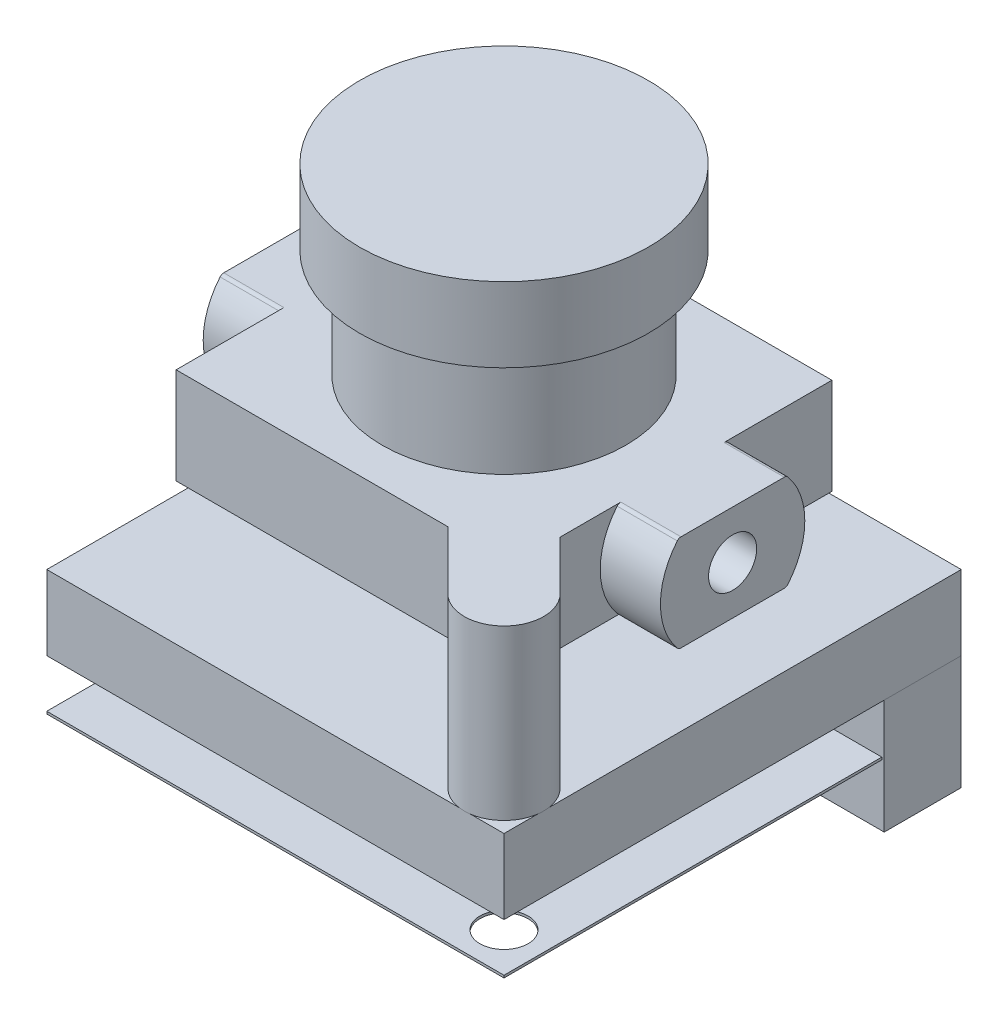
ISO-10303-21;
HEADER;
FILE_DESCRIPTION(('STEP AP214'),'2;1');
FILE_NAME('part.step','',(''),(''),'','','');
FILE_SCHEMA(('AUTOMOTIVE_DESIGN { 1 0 10303 214 1 1 1 1 }'));
ENDSEC;
DATA;
#1=APPLICATION_CONTEXT('core data for automotive mechanical design processes');
#2=APPLICATION_PROTOCOL_DEFINITION('international standard','automotive_design',2000,#1);
#3=PRODUCT_CONTEXT('',#1,'mechanical');
#4=PRODUCT('Part','Part','',(#3));
#5=PRODUCT_RELATED_PRODUCT_CATEGORY('part','',(#4));
#6=PRODUCT_DEFINITION_FORMATION('','',#4);
#7=PRODUCT_DEFINITION_CONTEXT('part definition',#1,'design');
#8=PRODUCT_DEFINITION('design','',#6,#7);
#9=PRODUCT_DEFINITION_SHAPE('','',#8);
#10=(LENGTH_UNIT() NAMED_UNIT(*) SI_UNIT(.MILLI.,.METRE.));
#11=(NAMED_UNIT(*) PLANE_ANGLE_UNIT() SI_UNIT($,.RADIAN.));
#12=(NAMED_UNIT(*) SI_UNIT($,.STERADIAN.) SOLID_ANGLE_UNIT());
#13=UNCERTAINTY_MEASURE_WITH_UNIT(LENGTH_MEASURE(1.E-05),#10,'distance_accuracy_value','');
#14=(GEOMETRIC_REPRESENTATION_CONTEXT(3) GLOBAL_UNCERTAINTY_ASSIGNED_CONTEXT((#13)) GLOBAL_UNIT_ASSIGNED_CONTEXT((#10,
#11,#12)) REPRESENTATION_CONTEXT('',''));
#15=CARTESIAN_POINT('',(0.,0.,0.));
#16=DIRECTION('',(0.,0.,1.));
#17=DIRECTION('',(1.,0.,0.));
#18=AXIS2_PLACEMENT_3D('',#15,#16,#17);
#19=CARTESIAN_POINT('',(0.,11.5,0.));
#20=DIRECTION('',(0.,1.,0.));
#21=DIRECTION('',(1.,0.,0.));
#22=AXIS2_PLACEMENT_3D('',#19,#20,#21);
#23=PLANE('',#22);
#24=CARTESIAN_POINT('',(0.,11.5,0.));
#25=DIRECTION('',(0.,1.,0.));
#26=DIRECTION('',(0.,0.,1.));
#27=AXIS2_PLACEMENT_3D('',#24,#25,#26);
#28=CIRCLE('',#27,6.);
#29=CARTESIAN_POINT('',(0.,11.5,6.));
#30=VERTEX_POINT('',#29);
#31=EDGE_CURVE('P0_E20',#30,#30,#28,.T.);
#32=ORIENTED_EDGE('',*,*,#31,.F.);
#33=EDGE_LOOP('',(#32));
#34=FACE_BOUND('',#33,.T.);
#35=ADVANCED_FACE('P0_F17',(#34),#23,.F.);
#36=CARTESIAN_POINT('',(0.,14.6,0.));
#37=DIRECTION('',(0.,1.,0.));
#38=DIRECTION('',(1.,0.,0.));
#39=AXIS2_PLACEMENT_3D('',#36,#37,#38);
#40=PLANE('',#39);
#41=CARTESIAN_POINT('',(0.,14.6,0.));
#42=DIRECTION('',(0.,1.,0.));
#43=DIRECTION('',(0.,0.,1.));
#44=AXIS2_PLACEMENT_3D('',#41,#42,#43);
#45=CIRCLE('',#44,6.);
#46=CARTESIAN_POINT('',(0.,14.6,6.));
#47=VERTEX_POINT('',#46);
#48=EDGE_CURVE('P0_E11',#47,#47,#45,.T.);
#49=ORIENTED_EDGE('',*,*,#48,.T.);
#50=EDGE_LOOP('',(#49));
#51=FACE_BOUND('',#50,.T.);
#52=ADVANCED_FACE('P0_F58',(#51),#40,.T.);
#53=CARTESIAN_POINT('',(0.,14.6,0.));
#54=DIRECTION('',(0.,-1.,0.));
#55=DIRECTION('',(0.,0.,-1.));
#56=AXIS2_PLACEMENT_3D('',#53,#54,#55);
#57=CYLINDRICAL_SURFACE('',#56,6.);
#58=ORIENTED_EDGE('',*,*,#31,.T.);
#59=DIRECTION('',(0.,1.,0.));
#60=VECTOR('',#59,1.);
#61=CARTESIAN_POINT('',(0.,14.6,6.));
#62=LINE('',#61,#60);
#63=EDGE_CURVE('P0_E26',#30,#47,#62,.T.);
#64=ORIENTED_EDGE('',*,*,#63,.T.);
#65=ORIENTED_EDGE('',*,*,#48,.F.);
#66=ORIENTED_EDGE('',*,*,#63,.F.);
#67=EDGE_LOOP('',(#58,#64,#65,#66));
#68=FACE_BOUND('',#67,.T.);
#69=ADVANCED_FACE('P0_F41',(#68),#57,.T.);
#70=CLOSED_SHELL('',(#35,#52,#69));
#71=MANIFOLD_SOLID_BREP('P0_B1',#70);
#72=CARTESIAN_POINT('',(0.,-7.85,-6.7));
#73=DIRECTION('',(0.,0.,-1.));
#74=DIRECTION('',(0.,-1.,0.));
#75=AXIS2_PLACEMENT_3D('',#72,#73,#74);
#76=PLANE('',#75);
#77=DIRECTION('',(-1.,0.,0.));
#78=VECTOR('',#77,1.);
#79=CARTESIAN_POINT('',(9.1,-3.1,-6.7));
#80=LINE('',#79,#78);
#81=CARTESIAN_POINT('',(9.1,-3.1,-6.7));
#82=VERTEX_POINT('',#81);
#83=CARTESIAN_POINT('',(4.4,-3.1,-6.7));
#84=VERTEX_POINT('',#83);
#85=EDGE_CURVE('P1_E111',#82,#84,#80,.T.);
#86=ORIENTED_EDGE('',*,*,#85,.F.);
#87=DIRECTION('',(0.,1.,0.));
#88=VECTOR('',#87,1.);
#89=CARTESIAN_POINT('',(9.1,-7.85,-6.7));
#90=LINE('',#89,#88);
#91=CARTESIAN_POINT('',(9.1,-7.85,-6.7));
#92=VERTEX_POINT('',#91);
#93=EDGE_CURVE('P1_E11',#92,#82,#90,.T.);
#94=ORIENTED_EDGE('',*,*,#93,.F.);
#95=DIRECTION('',(-1.,0.,0.));
#96=VECTOR('',#95,1.);
#97=CARTESIAN_POINT('',(9.1,-7.85,-6.7));
#98=LINE('',#97,#96);
#99=CARTESIAN_POINT('',(4.4,-7.85,-6.7));
#100=VERTEX_POINT('',#99);
#101=EDGE_CURVE('P1_E182',#92,#100,#98,.T.);
#102=ORIENTED_EDGE('',*,*,#101,.T.);
#103=DIRECTION('',(0.,1.,0.));
#104=VECTOR('',#103,1.);
#105=CARTESIAN_POINT('',(4.4,-7.85,-6.7));
#106=LINE('',#105,#104);
#107=EDGE_CURVE('P1_E143',#100,#84,#106,.T.);
#108=ORIENTED_EDGE('',*,*,#107,.T.);
#109=EDGE_LOOP('',(#86,#94,#102,#108));
#110=FACE_BOUND('',#109,.T.);
#111=ADVANCED_FACE('P1_F17',(#110),#76,.T.);
#112=CARTESIAN_POINT('',(9.1,-7.85,0.));
#113=DIRECTION('',(1.,0.,0.));
#114=DIRECTION('',(0.,1.,0.));
#115=AXIS2_PLACEMENT_3D('',#112,#113,#114);
#116=PLANE('',#115);
#117=DIRECTION('',(0.,0.,-1.));
#118=VECTOR('',#117,1.);
#119=CARTESIAN_POINT('',(9.1,-3.1,-6.7));
#120=LINE('',#119,#118);
#121=CARTESIAN_POINT('',(9.1,-3.1,-9.1));
#122=VERTEX_POINT('',#121);
#123=EDGE_CURVE('P1_E139',#82,#122,#120,.T.);
#124=ORIENTED_EDGE('',*,*,#123,.T.);
#125=DIRECTION('',(0.,1.,0.));
#126=VECTOR('',#125,1.);
#127=CARTESIAN_POINT('',(9.1,-7.85,-9.1));
#128=LINE('',#127,#126);
#129=CARTESIAN_POINT('',(9.1,-7.85,-9.1));
#130=VERTEX_POINT('',#129);
#131=EDGE_CURVE('P1_E28',#130,#122,#128,.T.);
#132=ORIENTED_EDGE('',*,*,#131,.F.);
#133=DIRECTION('',(0.,0.,-1.));
#134=VECTOR('',#133,1.);
#135=CARTESIAN_POINT('',(9.1,-7.85,-6.7));
#136=LINE('',#135,#134);
#137=EDGE_CURVE('P1_E176',#92,#130,#136,.T.);
#138=ORIENTED_EDGE('',*,*,#137,.F.);
#139=ORIENTED_EDGE('',*,*,#93,.T.);
#140=EDGE_LOOP('',(#124,#132,#138,#139));
#141=FACE_BOUND('',#140,.T.);
#142=ADVANCED_FACE('P1_F215',(#141),#116,.F.);
#143=CARTESIAN_POINT('',(0.,-7.85,-9.1));
#144=DIRECTION('',(0.,0.,-1.));
#145=DIRECTION('',(0.,-1.,0.));
#146=AXIS2_PLACEMENT_3D('',#143,#144,#145);
#147=PLANE('',#146);
#148=DIRECTION('',(-1.,0.,0.));
#149=VECTOR('',#148,1.);
#150=CARTESIAN_POINT('',(9.1,-3.1,-9.1));
#151=LINE('',#150,#149);
#152=CARTESIAN_POINT('',(4.4,-3.1,-9.1));
#153=VERTEX_POINT('',#152);
#154=EDGE_CURVE('P1_E146',#122,#153,#151,.T.);
#155=ORIENTED_EDGE('',*,*,#154,.T.);
#156=DIRECTION('',(0.,1.,0.));
#157=VECTOR('',#156,1.);
#158=CARTESIAN_POINT('',(4.4,-7.85,-9.1));
#159=LINE('',#158,#157);
#160=CARTESIAN_POINT('',(4.4,-7.85,-9.1));
#161=VERTEX_POINT('',#160);
#162=EDGE_CURVE('P1_E165',#161,#153,#159,.T.);
#163=ORIENTED_EDGE('',*,*,#162,.F.);
#164=DIRECTION('',(-1.,0.,0.));
#165=VECTOR('',#164,1.);
#166=CARTESIAN_POINT('',(9.1,-7.85,-9.1));
#167=LINE('',#166,#165);
#168=EDGE_CURVE('P1_E189',#130,#161,#167,.T.);
#169=ORIENTED_EDGE('',*,*,#168,.F.);
#170=ORIENTED_EDGE('',*,*,#131,.T.);
#171=EDGE_LOOP('',(#155,#163,#169,#170));
#172=FACE_BOUND('',#171,.T.);
#173=ADVANCED_FACE('P1_F212',(#172),#147,.F.);
#174=CARTESIAN_POINT('',(4.4,-7.85,0.));
#175=DIRECTION('',(1.,0.,0.));
#176=DIRECTION('',(0.,1.,0.));
#177=AXIS2_PLACEMENT_3D('',#174,#175,#176);
#178=PLANE('',#177);
#179=DIRECTION('',(0.,0.,-1.));
#180=VECTOR('',#179,1.);
#181=CARTESIAN_POINT('',(4.4,-3.1,-6.7));
#182=LINE('',#181,#180);
#183=EDGE_CURVE('P1_E134',#84,#153,#182,.T.);
#184=ORIENTED_EDGE('',*,*,#183,.F.);
#185=ORIENTED_EDGE('',*,*,#107,.F.);
#186=DIRECTION('',(0.,0.,-1.));
#187=VECTOR('',#186,1.);
#188=CARTESIAN_POINT('',(4.4,-7.85,-6.7));
#189=LINE('',#188,#187);
#190=EDGE_CURVE('P1_E185',#100,#161,#189,.T.);
#191=ORIENTED_EDGE('',*,*,#190,.T.);
#192=ORIENTED_EDGE('',*,*,#162,.T.);
#193=EDGE_LOOP('',(#184,#185,#191,#192));
#194=FACE_BOUND('',#193,.T.);
#195=ADVANCED_FACE('P1_F209',(#194),#178,.T.);
#196=CARTESIAN_POINT('',(4.,-7.85,0.));
#197=DIRECTION('',(1.,0.,0.));
#198=DIRECTION('',(0.,1.,0.));
#199=AXIS2_PLACEMENT_3D('',#196,#197,#198);
#200=PLANE('',#199);
#201=DIRECTION('',(0.,0.,-1.));
#202=VECTOR('',#201,1.);
#203=CARTESIAN_POINT('',(4.,-3.1,-6.3));
#204=LINE('',#203,#202);
#205=CARTESIAN_POINT('',(4.,-3.1,-6.3));
#206=VERTEX_POINT('',#205);
#207=CARTESIAN_POINT('',(4.,-3.1,-9.5));
#208=VERTEX_POINT('',#207);
#209=EDGE_CURVE('P1_E166',#206,#208,#204,.T.);
#210=ORIENTED_EDGE('',*,*,#209,.T.);
#211=DIRECTION('',(0.,1.,0.));
#212=VECTOR('',#211,1.);
#213=CARTESIAN_POINT('',(4.,-7.85,-9.5));
#214=LINE('',#213,#212);
#215=CARTESIAN_POINT('',(4.,-7.85,-9.5));
#216=VERTEX_POINT('',#215);
#217=EDGE_CURVE('P1_E110',#216,#208,#214,.T.);
#218=ORIENTED_EDGE('',*,*,#217,.F.);
#219=DIRECTION('',(0.,0.,-1.));
#220=VECTOR('',#219,1.);
#221=CARTESIAN_POINT('',(4.,-7.85,-6.3));
#222=LINE('',#221,#220);
#223=CARTESIAN_POINT('',(4.,-7.85,-6.3));
#224=VERTEX_POINT('',#223);
#225=EDGE_CURVE('P1_E126',#224,#216,#222,.T.);
#226=ORIENTED_EDGE('',*,*,#225,.F.);
#227=DIRECTION('',(0.,1.,0.));
#228=VECTOR('',#227,1.);
#229=CARTESIAN_POINT('',(4.,-7.85,-6.3));
#230=LINE('',#229,#228);
#231=EDGE_CURVE('P1_E140',#224,#206,#230,.T.);
#232=ORIENTED_EDGE('',*,*,#231,.T.);
#233=EDGE_LOOP('',(#210,#218,#226,#232));
#234=FACE_BOUND('',#233,.T.);
#235=ADVANCED_FACE('P1_F235',(#234),#200,.F.);
#236=CARTESIAN_POINT('',(0.,-7.85,-6.3));
#237=DIRECTION('',(0.,0.,-1.));
#238=DIRECTION('',(0.,-1.,0.));
#239=AXIS2_PLACEMENT_3D('',#236,#237,#238);
#240=PLANE('',#239);
#241=DIRECTION('',(-1.,0.,0.));
#242=VECTOR('',#241,1.);
#243=CARTESIAN_POINT('',(9.5,-3.1,-6.3));
#244=LINE('',#243,#242);
#245=CARTESIAN_POINT('',(9.5,-3.1,-6.3));
#246=VERTEX_POINT('',#245);
#247=EDGE_CURVE('P1_E161',#246,#206,#244,.T.);
#248=ORIENTED_EDGE('',*,*,#247,.T.);
#249=ORIENTED_EDGE('',*,*,#231,.F.);
#250=DIRECTION('',(-1.,0.,0.));
#251=VECTOR('',#250,1.);
#252=CARTESIAN_POINT('',(9.5,-7.85,-6.3));
#253=LINE('',#252,#251);
#254=CARTESIAN_POINT('',(9.5,-7.85,-6.3));
#255=VERTEX_POINT('',#254);
#256=EDGE_CURVE('P1_E121',#255,#224,#253,.T.);
#257=ORIENTED_EDGE('',*,*,#256,.F.);
#258=DIRECTION('',(0.,1.,0.));
#259=VECTOR('',#258,1.);
#260=CARTESIAN_POINT('',(9.5,-7.85,-6.3));
#261=LINE('',#260,#259);
#262=EDGE_CURVE('P1_E21',#255,#246,#261,.T.);
#263=ORIENTED_EDGE('',*,*,#262,.T.);
#264=EDGE_LOOP('',(#248,#249,#257,#263));
#265=FACE_BOUND('',#264,.T.);
#266=ADVANCED_FACE('P1_F19',(#265),#240,.F.);
#267=CARTESIAN_POINT('',(9.5,-7.85,0.));
#268=DIRECTION('',(-1.,0.,0.));
#269=DIRECTION('',(0.,0.,1.));
#270=AXIS2_PLACEMENT_3D('',#267,#268,#269);
#271=PLANE('',#270);
#272=DIRECTION('',(0.,0.,1.));
#273=VECTOR('',#272,1.);
#274=CARTESIAN_POINT('',(9.5,-3.1,-9.5));
#275=LINE('',#274,#273);
#276=CARTESIAN_POINT('',(9.5,-3.1,-9.5));
#277=VERTEX_POINT('',#276);
#278=EDGE_CURVE('P1_E159',#277,#246,#275,.T.);
#279=ORIENTED_EDGE('',*,*,#278,.T.);
#280=ORIENTED_EDGE('',*,*,#262,.F.);
#281=DIRECTION('',(0.,0.,1.));
#282=VECTOR('',#281,1.);
#283=CARTESIAN_POINT('',(9.5,-7.85,-9.5));
#284=LINE('',#283,#282);
#285=CARTESIAN_POINT('',(9.5,-7.85,-9.5));
#286=VERTEX_POINT('',#285);
#287=EDGE_CURVE('P1_E115',#286,#255,#284,.T.);
#288=ORIENTED_EDGE('',*,*,#287,.F.);
#289=DIRECTION('',(0.,1.,0.));
#290=VECTOR('',#289,1.);
#291=CARTESIAN_POINT('',(9.5,-7.85,-9.5));
#292=LINE('',#291,#290);
#293=EDGE_CURVE('P1_E99',#286,#277,#292,.T.);
#294=ORIENTED_EDGE('',*,*,#293,.T.);
#295=EDGE_LOOP('',(#279,#280,#288,#294));
#296=FACE_BOUND('',#295,.T.);
#297=ADVANCED_FACE('P1_F116',(#296),#271,.F.);
#298=CARTESIAN_POINT('',(0.,-7.85,-9.5));
#299=DIRECTION('',(0.,0.,-1.));
#300=DIRECTION('',(0.,-1.,0.));
#301=AXIS2_PLACEMENT_3D('',#298,#299,#300);
#302=PLANE('',#301);
#303=DIRECTION('',(-1.,0.,0.));
#304=VECTOR('',#303,1.);
#305=CARTESIAN_POINT('',(9.5,-3.1,-9.5));
#306=LINE('',#305,#304);
#307=EDGE_CURVE('P1_E105',#277,#208,#306,.T.);
#308=ORIENTED_EDGE('',*,*,#307,.F.);
#309=ORIENTED_EDGE('',*,*,#293,.F.);
#310=DIRECTION('',(-1.,0.,0.));
#311=VECTOR('',#310,1.);
#312=CARTESIAN_POINT('',(9.5,-7.85,-9.5));
#313=LINE('',#312,#311);
#314=EDGE_CURVE('P1_E103',#286,#216,#313,.T.);
#315=ORIENTED_EDGE('',*,*,#314,.T.);
#316=ORIENTED_EDGE('',*,*,#217,.T.);
#317=EDGE_LOOP('',(#308,#309,#315,#316));
#318=FACE_BOUND('',#317,.T.);
#319=ADVANCED_FACE('P1_F101',(#318),#302,.T.);
#320=CARTESIAN_POINT('',(0.,-3.1,0.));
#321=DIRECTION('',(0.,-1.,0.));
#322=DIRECTION('',(0.,0.,-1.));
#323=AXIS2_PLACEMENT_3D('',#320,#321,#322);
#324=PLANE('',#323);
#325=ORIENTED_EDGE('',*,*,#183,.T.);
#326=ORIENTED_EDGE('',*,*,#154,.F.);
#327=ORIENTED_EDGE('',*,*,#123,.F.);
#328=ORIENTED_EDGE('',*,*,#85,.T.);
#329=EDGE_LOOP('',(#325,#326,#327,#328));
#330=FACE_BOUND('',#329,.T.);
#331=ORIENTED_EDGE('',*,*,#307,.T.);
#332=ORIENTED_EDGE('',*,*,#209,.F.);
#333=ORIENTED_EDGE('',*,*,#247,.F.);
#334=ORIENTED_EDGE('',*,*,#278,.F.);
#335=EDGE_LOOP('',(#331,#332,#333,#334));
#336=FACE_BOUND('',#335,.T.);
#337=ADVANCED_FACE('P1_F233',(#330,#336),#324,.F.);
#338=CARTESIAN_POINT('',(0.,-7.85,0.));
#339=DIRECTION('',(0.,-1.,0.));
#340=DIRECTION('',(0.,0.,-1.));
#341=AXIS2_PLACEMENT_3D('',#338,#339,#340);
#342=PLANE('',#341);
#343=ORIENTED_EDGE('',*,*,#168,.T.);
#344=ORIENTED_EDGE('',*,*,#190,.F.);
#345=ORIENTED_EDGE('',*,*,#101,.F.);
#346=ORIENTED_EDGE('',*,*,#137,.T.);
#347=EDGE_LOOP('',(#343,#344,#345,#346));
#348=FACE_BOUND('',#347,.T.);
#349=ORIENTED_EDGE('',*,*,#314,.F.);
#350=ORIENTED_EDGE('',*,*,#287,.T.);
#351=ORIENTED_EDGE('',*,*,#256,.T.);
#352=ORIENTED_EDGE('',*,*,#225,.T.);
#353=EDGE_LOOP('',(#349,#350,#351,#352));
#354=FACE_BOUND('',#353,.T.);
#355=ADVANCED_FACE('P1_F124',(#348,#354),#342,.T.);
#356=CLOSED_SHELL('',(#111,#142,#173,#195,#235,#266,#297,#319,#337,#355));
#357=MANIFOLD_SOLID_BREP('P1_B1',#356);
#358=CARTESIAN_POINT('',(3.5,-7.85,0.));
#359=DIRECTION('',(1.,0.,0.));
#360=DIRECTION('',(0.,0.,-1.));
#361=AXIS2_PLACEMENT_3D('',#358,#359,#360);
#362=PLANE('',#361);
#363=DIRECTION('',(0.,0.,-1.));
#364=VECTOR('',#363,1.);
#365=CARTESIAN_POINT('',(3.5,-3.1,-6.7));
#366=LINE('',#365,#364);
#367=CARTESIAN_POINT('',(3.5,-3.1,-6.7));
#368=VERTEX_POINT('',#367);
#369=CARTESIAN_POINT('',(3.5,-3.1,-9.1));
#370=VERTEX_POINT('',#369);
#371=EDGE_CURVE('P2_E151',#368,#370,#366,.T.);
#372=ORIENTED_EDGE('',*,*,#371,.T.);
#373=DIRECTION('',(0.,1.,0.));
#374=VECTOR('',#373,1.);
#375=CARTESIAN_POINT('',(3.5,-7.85,-9.1));
#376=LINE('',#375,#374);
#377=CARTESIAN_POINT('',(3.5,-7.85,-9.1));
#378=VERTEX_POINT('',#377);
#379=EDGE_CURVE('P2_E11',#378,#370,#376,.T.);
#380=ORIENTED_EDGE('',*,*,#379,.F.);
#381=DIRECTION('',(0.,0.,-1.));
#382=VECTOR('',#381,1.);
#383=CARTESIAN_POINT('',(3.5,-7.85,-6.7));
#384=LINE('',#383,#382);
#385=CARTESIAN_POINT('',(3.5,-7.85,-6.7));
#386=VERTEX_POINT('',#385);
#387=EDGE_CURVE('P2_E179',#386,#378,#384,.T.);
#388=ORIENTED_EDGE('',*,*,#387,.F.);
#389=DIRECTION('',(0.,1.,0.));
#390=VECTOR('',#389,1.);
#391=CARTESIAN_POINT('',(3.5,-7.85,-6.7));
#392=LINE('',#391,#390);
#393=EDGE_CURVE('P2_E85',#386,#368,#392,.T.);
#394=ORIENTED_EDGE('',*,*,#393,.T.);
#395=EDGE_LOOP('',(#372,#380,#388,#394));
#396=FACE_BOUND('',#395,.T.);
#397=ADVANCED_FACE('P2_F17',(#396),#362,.F.);
#398=CARTESIAN_POINT('',(0.,-7.85,-9.1));
#399=DIRECTION('',(0.,0.,-1.));
#400=DIRECTION('',(0.,-1.,0.));
#401=AXIS2_PLACEMENT_3D('',#398,#399,#400);
#402=PLANE('',#401);
#403=DIRECTION('',(-1.,0.,0.));
#404=VECTOR('',#403,1.);
#405=CARTESIAN_POINT('',(3.5,-3.1,-9.1));
#406=LINE('',#405,#404);
#407=CARTESIAN_POINT('',(0.0999999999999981,-3.1,-9.1));
#408=VERTEX_POINT('',#407);
#409=EDGE_CURVE('P2_E187',#370,#408,#406,.T.);
#410=ORIENTED_EDGE('',*,*,#409,.T.);
#411=DIRECTION('',(0.,1.,0.));
#412=VECTOR('',#411,1.);
#413=CARTESIAN_POINT('',(0.0999999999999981,-7.85,-9.1));
#414=LINE('',#413,#412);
#415=CARTESIAN_POINT('',(0.0999999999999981,-7.85,-9.1));
#416=VERTEX_POINT('',#415);
#417=EDGE_CURVE('P2_E27',#416,#408,#414,.T.);
#418=ORIENTED_EDGE('',*,*,#417,.F.);
#419=DIRECTION('',(-1.,0.,0.));
#420=VECTOR('',#419,1.);
#421=CARTESIAN_POINT('',(3.5,-7.85,-9.1));
#422=LINE('',#421,#420);
#423=EDGE_CURVE('P2_E170',#378,#416,#422,.T.);
#424=ORIENTED_EDGE('',*,*,#423,.F.);
#425=ORIENTED_EDGE('',*,*,#379,.T.);
#426=EDGE_LOOP('',(#410,#418,#424,#425));
#427=FACE_BOUND('',#426,.T.);
#428=ADVANCED_FACE('P2_F19',(#427),#402,.F.);
#429=CARTESIAN_POINT('',(0.1,-7.85,0.));
#430=DIRECTION('',(1.,0.,0.));
#431=DIRECTION('',(0.,0.,-1.));
#432=AXIS2_PLACEMENT_3D('',#429,#430,#431);
#433=PLANE('',#432);
#434=DIRECTION('',(0.,0.,-1.));
#435=VECTOR('',#434,1.);
#436=CARTESIAN_POINT('',(0.0999999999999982,-3.1,-6.7));
#437=LINE('',#436,#435);
#438=CARTESIAN_POINT('',(0.0999999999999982,-3.1,-6.7));
#439=VERTEX_POINT('',#438);
#440=EDGE_CURVE('P2_E182',#439,#408,#437,.T.);
#441=ORIENTED_EDGE('',*,*,#440,.F.);
#442=DIRECTION('',(0.,1.,0.));
#443=VECTOR('',#442,1.);
#444=CARTESIAN_POINT('',(0.0999999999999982,-7.85,-6.7));
#445=LINE('',#444,#443);
#446=CARTESIAN_POINT('',(0.0999999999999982,-7.85,-6.7));
#447=VERTEX_POINT('',#446);
#448=EDGE_CURVE('P2_E143',#447,#439,#445,.T.);
#449=ORIENTED_EDGE('',*,*,#448,.F.);
#450=DIRECTION('',(0.,0.,-1.));
#451=VECTOR('',#450,1.);
#452=CARTESIAN_POINT('',(0.0999999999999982,-7.85,-6.7));
#453=LINE('',#452,#451);
#454=EDGE_CURVE('P2_E165',#447,#416,#453,.T.);
#455=ORIENTED_EDGE('',*,*,#454,.T.);
#456=ORIENTED_EDGE('',*,*,#417,.T.);
#457=EDGE_LOOP('',(#441,#449,#455,#456));
#458=FACE_BOUND('',#457,.T.);
#459=ADVANCED_FACE('P2_F207',(#458),#433,.T.);
#460=CARTESIAN_POINT('',(0.,-7.85,-6.7));
#461=DIRECTION('',(0.,0.,-1.));
#462=DIRECTION('',(0.,-1.,0.));
#463=AXIS2_PLACEMENT_3D('',#460,#461,#462);
#464=PLANE('',#463);
#465=DIRECTION('',(-1.,0.,0.));
#466=VECTOR('',#465,1.);
#467=CARTESIAN_POINT('',(3.5,-3.1,-6.7));
#468=LINE('',#467,#466);
#469=EDGE_CURVE('P2_E155',#368,#439,#468,.T.);
#470=ORIENTED_EDGE('',*,*,#469,.F.);
#471=ORIENTED_EDGE('',*,*,#393,.F.);
#472=DIRECTION('',(-1.,0.,0.));
#473=VECTOR('',#472,1.);
#474=CARTESIAN_POINT('',(3.5,-7.85,-6.7));
#475=LINE('',#474,#473);
#476=EDGE_CURVE('P2_E128',#386,#447,#475,.T.);
#477=ORIENTED_EDGE('',*,*,#476,.T.);
#478=ORIENTED_EDGE('',*,*,#448,.T.);
#479=EDGE_LOOP('',(#470,#471,#477,#478));
#480=FACE_BOUND('',#479,.T.);
#481=ADVANCED_FACE('P2_F212',(#480),#464,.T.);
#482=CARTESIAN_POINT('',(0.,-7.85,-6.3));
#483=DIRECTION('',(0.,0.,-1.));
#484=DIRECTION('',(0.,-1.,0.));
#485=AXIS2_PLACEMENT_3D('',#482,#483,#484);
#486=PLANE('',#485);
#487=DIRECTION('',(-1.,0.,0.));
#488=VECTOR('',#487,1.);
#489=CARTESIAN_POINT('',(3.9,-3.1,-6.3));
#490=LINE('',#489,#488);
#491=CARTESIAN_POINT('',(3.9,-3.1,-6.3));
#492=VERTEX_POINT('',#491);
#493=CARTESIAN_POINT('',(-0.3,-3.1,-6.3));
#494=VERTEX_POINT('',#493);
#495=EDGE_CURVE('P2_E112',#492,#494,#490,.T.);
#496=ORIENTED_EDGE('',*,*,#495,.T.);
#497=DIRECTION('',(0.,1.,0.));
#498=VECTOR('',#497,1.);
#499=CARTESIAN_POINT('',(-0.3,-7.85,-6.3));
#500=LINE('',#499,#498);
#501=CARTESIAN_POINT('',(-0.3,-7.85,-6.3));
#502=VERTEX_POINT('',#501);
#503=EDGE_CURVE('P2_E106',#502,#494,#500,.T.);
#504=ORIENTED_EDGE('',*,*,#503,.F.);
#505=DIRECTION('',(-1.,0.,0.));
#506=VECTOR('',#505,1.);
#507=CARTESIAN_POINT('',(3.9,-7.85,-6.3));
#508=LINE('',#507,#506);
#509=CARTESIAN_POINT('',(3.9,-7.85,-6.3));
#510=VERTEX_POINT('',#509);
#511=EDGE_CURVE('P2_E109',#510,#502,#508,.T.);
#512=ORIENTED_EDGE('',*,*,#511,.F.);
#513=DIRECTION('',(0.,1.,0.));
#514=VECTOR('',#513,1.);
#515=CARTESIAN_POINT('',(3.9,-7.85,-6.3));
#516=LINE('',#515,#514);
#517=EDGE_CURVE('P2_E96',#510,#492,#516,.T.);
#518=ORIENTED_EDGE('',*,*,#517,.T.);
#519=EDGE_LOOP('',(#496,#504,#512,#518));
#520=FACE_BOUND('',#519,.T.);
#521=ADVANCED_FACE('P2_F108',(#520),#486,.F.);
#522=CARTESIAN_POINT('',(3.9,-7.85,0.));
#523=DIRECTION('',(1.,0.,0.));
#524=DIRECTION('',(0.,1.,0.));
#525=AXIS2_PLACEMENT_3D('',#522,#523,#524);
#526=PLANE('',#525);
#527=DIRECTION('',(0.,0.,-1.));
#528=VECTOR('',#527,1.);
#529=CARTESIAN_POINT('',(3.9,-3.1,-6.3));
#530=LINE('',#529,#528);
#531=CARTESIAN_POINT('',(3.9,-3.1,-9.5));
#532=VERTEX_POINT('',#531);
#533=EDGE_CURVE('P2_E146',#492,#532,#530,.T.);
#534=ORIENTED_EDGE('',*,*,#533,.F.);
#535=ORIENTED_EDGE('',*,*,#517,.F.);
#536=DIRECTION('',(0.,0.,-1.));
#537=VECTOR('',#536,1.);
#538=CARTESIAN_POINT('',(3.9,-7.85,-6.3));
#539=LINE('',#538,#537);
#540=CARTESIAN_POINT('',(3.9,-7.85,-9.5));
#541=VERTEX_POINT('',#540);
#542=EDGE_CURVE('P2_E126',#510,#541,#539,.T.);
#543=ORIENTED_EDGE('',*,*,#542,.T.);
#544=DIRECTION('',(0.,1.,0.));
#545=VECTOR('',#544,1.);
#546=CARTESIAN_POINT('',(3.9,-7.85,-9.5));
#547=LINE('',#546,#545);
#548=EDGE_CURVE('P2_E118',#541,#532,#547,.T.);
#549=ORIENTED_EDGE('',*,*,#548,.T.);
#550=EDGE_LOOP('',(#534,#535,#543,#549));
#551=FACE_BOUND('',#550,.T.);
#552=ADVANCED_FACE('P2_F220',(#551),#526,.T.);
#553=CARTESIAN_POINT('',(0.,-7.85,-9.5));
#554=DIRECTION('',(0.,0.,-1.));
#555=DIRECTION('',(0.,-1.,0.));
#556=AXIS2_PLACEMENT_3D('',#553,#554,#555);
#557=PLANE('',#556);
#558=DIRECTION('',(-1.,0.,0.));
#559=VECTOR('',#558,1.);
#560=CARTESIAN_POINT('',(3.9,-3.1,-9.5));
#561=LINE('',#560,#559);
#562=CARTESIAN_POINT('',(-0.3,-3.1,-9.5));
#563=VERTEX_POINT('',#562);
#564=EDGE_CURVE('P2_E150',#532,#563,#561,.T.);
#565=ORIENTED_EDGE('',*,*,#564,.F.);
#566=ORIENTED_EDGE('',*,*,#548,.F.);
#567=DIRECTION('',(-1.,0.,0.));
#568=VECTOR('',#567,1.);
#569=CARTESIAN_POINT('',(3.9,-7.85,-9.5));
#570=LINE('',#569,#568);
#571=CARTESIAN_POINT('',(-0.3,-7.85,-9.5));
#572=VERTEX_POINT('',#571);
#573=EDGE_CURVE('P2_E133',#541,#572,#570,.T.);
#574=ORIENTED_EDGE('',*,*,#573,.T.);
#575=DIRECTION('',(0.,1.,0.));
#576=VECTOR('',#575,1.);
#577=CARTESIAN_POINT('',(-0.3,-7.85,-9.5));
#578=LINE('',#577,#576);
#579=EDGE_CURVE('P2_E119',#572,#563,#578,.T.);
#580=ORIENTED_EDGE('',*,*,#579,.T.);
#581=EDGE_LOOP('',(#565,#566,#574,#580));
#582=FACE_BOUND('',#581,.T.);
#583=ADVANCED_FACE('P2_F231',(#582),#557,.T.);
#584=CARTESIAN_POINT('',(-0.3,-7.85,0.));
#585=DIRECTION('',(1.,0.,0.));
#586=DIRECTION('',(0.,0.,-1.));
#587=AXIS2_PLACEMENT_3D('',#584,#585,#586);
#588=PLANE('',#587);
#589=DIRECTION('',(0.,0.,-1.));
#590=VECTOR('',#589,1.);
#591=CARTESIAN_POINT('',(-0.3,-3.1,-6.3));
#592=LINE('',#591,#590);
#593=EDGE_CURVE('P2_E161',#494,#563,#592,.T.);
#594=ORIENTED_EDGE('',*,*,#593,.T.);
#595=ORIENTED_EDGE('',*,*,#579,.F.);
#596=DIRECTION('',(0.,0.,-1.));
#597=VECTOR('',#596,1.);
#598=CARTESIAN_POINT('',(-0.3,-7.85,-6.3));
#599=LINE('',#598,#597);
#600=EDGE_CURVE('P2_E125',#502,#572,#599,.T.);
#601=ORIENTED_EDGE('',*,*,#600,.F.);
#602=ORIENTED_EDGE('',*,*,#503,.T.);
#603=EDGE_LOOP('',(#594,#595,#601,#602));
#604=FACE_BOUND('',#603,.T.);
#605=ADVANCED_FACE('P2_F130',(#604),#588,.F.);
#606=CARTESIAN_POINT('',(0.,-3.1,0.));
#607=DIRECTION('',(0.,1.,0.));
#608=DIRECTION('',(1.,0.,0.));
#609=AXIS2_PLACEMENT_3D('',#606,#607,#608);
#610=PLANE('',#609);
#611=ORIENTED_EDGE('',*,*,#371,.F.);
#612=ORIENTED_EDGE('',*,*,#469,.T.);
#613=ORIENTED_EDGE('',*,*,#440,.T.);
#614=ORIENTED_EDGE('',*,*,#409,.F.);
#615=EDGE_LOOP('',(#611,#612,#613,#614));
#616=FACE_BOUND('',#615,.T.);
#617=ORIENTED_EDGE('',*,*,#593,.F.);
#618=ORIENTED_EDGE('',*,*,#495,.F.);
#619=ORIENTED_EDGE('',*,*,#533,.T.);
#620=ORIENTED_EDGE('',*,*,#564,.T.);
#621=EDGE_LOOP('',(#617,#618,#619,#620));
#622=FACE_BOUND('',#621,.T.);
#623=ADVANCED_FACE('P2_F205',(#616,#622),#610,.T.);
#624=CARTESIAN_POINT('',(0.,-7.85,0.));
#625=DIRECTION('',(0.,1.,0.));
#626=DIRECTION('',(1.,0.,0.));
#627=AXIS2_PLACEMENT_3D('',#624,#625,#626);
#628=PLANE('',#627);
#629=ORIENTED_EDGE('',*,*,#476,.F.);
#630=ORIENTED_EDGE('',*,*,#387,.T.);
#631=ORIENTED_EDGE('',*,*,#423,.T.);
#632=ORIENTED_EDGE('',*,*,#454,.F.);
#633=EDGE_LOOP('',(#629,#630,#631,#632));
#634=FACE_BOUND('',#633,.T.);
#635=ORIENTED_EDGE('',*,*,#600,.T.);
#636=ORIENTED_EDGE('',*,*,#573,.F.);
#637=ORIENTED_EDGE('',*,*,#542,.F.);
#638=ORIENTED_EDGE('',*,*,#511,.T.);
#639=EDGE_LOOP('',(#635,#636,#637,#638));
#640=FACE_BOUND('',#639,.T.);
#641=ADVANCED_FACE('P2_F123',(#634,#640),#628,.F.);
#642=CLOSED_SHELL('',(#397,#428,#459,#481,#521,#552,#583,#605,#623,#641));
#643=MANIFOLD_SOLID_BREP('P2_B1',#642);
#644=CARTESIAN_POINT('',(-7.86656294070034,5.,-7.86656294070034));
#645=DIRECTION('',(0.,1.,0.));
#646=DIRECTION('',(1.,0.,0.));
#647=AXIS2_PLACEMENT_3D('',#644,#645,#646);
#648=PLANE('',#647);
#649=CARTESIAN_POINT('',(-7.86656294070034,5.,-7.86656294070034));
#650=DIRECTION('',(0.,1.,0.));
#651=DIRECTION('',(0.,0.,1.));
#652=AXIS2_PLACEMENT_3D('',#649,#650,#651);
#653=CIRCLE('',#652,1.);
#654=CARTESIAN_POINT('',(-7.86656294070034,5.,-6.86656294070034));
#655=VERTEX_POINT('',#654);
#656=CARTESIAN_POINT('',(-7.86656294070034,5.,-8.86656294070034));
#657=VERTEX_POINT('',#656);
#658=EDGE_CURVE('P3_E11',#655,#657,#653,.T.);
#659=ORIENTED_EDGE('',*,*,#658,.F.);
#660=CARTESIAN_POINT('',(-7.86656294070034,5.,-7.86656294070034));
#661=DIRECTION('',(0.,1.,0.));
#662=DIRECTION('',(0.,0.,1.));
#663=AXIS2_PLACEMENT_3D('',#660,#661,#662);
#664=CIRCLE('',#663,1.);
#665=EDGE_CURVE('P3_E28',#657,#655,#664,.T.);
#666=ORIENTED_EDGE('',*,*,#665,.F.);
#667=EDGE_LOOP('',(#659,#666));
#668=FACE_BOUND('',#667,.T.);
#669=ADVANCED_FACE('P3_F17',(#668),#648,.F.);
#670=CARTESIAN_POINT('',(-7.86656294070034,-7.85,-7.86656294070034));
#671=DIRECTION('',(0.,1.,0.));
#672=DIRECTION('',(0.,0.,1.));
#673=AXIS2_PLACEMENT_3D('',#670,#671,#672);
#674=CYLINDRICAL_SURFACE('',#673,1.);
#675=CARTESIAN_POINT('',(-7.86656294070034,0.,-7.86656294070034));
#676=DIRECTION('',(0.,1.,0.));
#677=DIRECTION('',(0.,0.,1.));
#678=AXIS2_PLACEMENT_3D('',#675,#676,#677);
#679=CIRCLE('',#678,1.);
#680=CARTESIAN_POINT('',(-7.86656294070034,0.,-6.86656294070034));
#681=VERTEX_POINT('',#680);
#682=CARTESIAN_POINT('',(-7.86656294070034,0.,-8.86656294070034));
#683=VERTEX_POINT('',#682);
#684=EDGE_CURVE('P3_E402',#681,#683,#679,.T.);
#685=ORIENTED_EDGE('',*,*,#684,.F.);
#686=CARTESIAN_POINT('',(-7.86656294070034,0.,-7.86656294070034));
#687=DIRECTION('',(0.,1.,0.));
#688=DIRECTION('',(0.,0.,1.));
#689=AXIS2_PLACEMENT_3D('',#686,#687,#688);
#690=CIRCLE('',#689,1.);
#691=EDGE_CURVE('P3_E285',#683,#681,#690,.T.);
#692=ORIENTED_EDGE('',*,*,#691,.F.);
#693=DIRECTION('',(0.,1.,0.));
#694=VECTOR('',#693,1.);
#695=CARTESIAN_POINT('',(-7.86656294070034,-7.85,-8.86656294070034));
#696=LINE('',#695,#694);
#697=EDGE_CURVE('P3_E497',#683,#657,#696,.T.);
#698=ORIENTED_EDGE('',*,*,#697,.T.);
#699=ORIENTED_EDGE('',*,*,#665,.T.);
#700=ORIENTED_EDGE('',*,*,#658,.T.);
#701=ORIENTED_EDGE('',*,*,#697,.F.);
#702=EDGE_LOOP('',(#685,#692,#698,#699,#700,#701));
#703=FACE_BOUND('',#702,.T.);
#704=ADVANCED_FACE('P3_F19',(#703),#674,.F.);
#705=CARTESIAN_POINT('',(7.86656294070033,5.,7.86656294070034));
#706=DIRECTION('',(0.,-1.,0.));
#707=DIRECTION('',(0.,0.,-1.));
#708=AXIS2_PLACEMENT_3D('',#705,#706,#707);
#709=PLANE('',#708);
#710=CARTESIAN_POINT('',(7.86656294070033,5.,7.86656294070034));
#711=DIRECTION('',(0.,-1.,0.));
#712=DIRECTION('',(0.,0.,-1.));
#713=AXIS2_PLACEMENT_3D('',#710,#711,#712);
#714=CIRCLE('',#713,1.);
#715=CARTESIAN_POINT('',(7.86656294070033,5.,6.86656294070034));
#716=VERTEX_POINT('',#715);
#717=EDGE_CURVE('P3_E530',#716,#716,#714,.T.);
#718=ORIENTED_EDGE('',*,*,#717,.T.);
#719=EDGE_LOOP('',(#718));
#720=FACE_BOUND('',#719,.T.);
#721=ADVANCED_FACE('P3_F779',(#720),#709,.T.);
#722=CARTESIAN_POINT('',(7.86656294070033,-7.85,7.86656294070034));
#723=DIRECTION('',(0.,1.,0.));
#724=DIRECTION('',(0.,0.,1.));
#725=AXIS2_PLACEMENT_3D('',#722,#723,#724);
#726=CYLINDRICAL_SURFACE('',#725,1.);
#727=CARTESIAN_POINT('',(7.86656294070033,0.,7.86656294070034));
#728=DIRECTION('',(0.,-1.,0.));
#729=DIRECTION('',(0.,0.,1.));
#730=AXIS2_PLACEMENT_3D('',#727,#728,#729);
#731=CIRCLE('',#730,1.);
#732=CARTESIAN_POINT('',(7.86656294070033,0.,8.86656294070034));
#733=VERTEX_POINT('',#732);
#734=CARTESIAN_POINT('',(7.86656294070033,0.,6.86656294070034));
#735=VERTEX_POINT('',#734);
#736=EDGE_CURVE('P3_E304',#733,#735,#731,.T.);
#737=ORIENTED_EDGE('',*,*,#736,.T.);
#738=DIRECTION('',(0.,1.,0.));
#739=VECTOR('',#738,1.);
#740=CARTESIAN_POINT('',(7.86656294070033,-7.85,6.86656294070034));
#741=LINE('',#740,#739);
#742=EDGE_CURVE('P3_E527',#735,#716,#741,.T.);
#743=ORIENTED_EDGE('',*,*,#742,.T.);
#744=ORIENTED_EDGE('',*,*,#717,.F.);
#745=ORIENTED_EDGE('',*,*,#742,.F.);
#746=CARTESIAN_POINT('',(7.86656294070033,0.,7.86656294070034));
#747=DIRECTION('',(0.,-1.,0.));
#748=DIRECTION('',(0.,0.,1.));
#749=AXIS2_PLACEMENT_3D('',#746,#747,#748);
#750=CIRCLE('',#749,1.);
#751=EDGE_CURVE('P3_E308',#735,#733,#750,.T.);
#752=ORIENTED_EDGE('',*,*,#751,.T.);
#753=EDGE_LOOP('',(#737,#743,#744,#745,#752));
#754=FACE_BOUND('',#753,.T.);
#755=ADVANCED_FACE('P3_F787',(#754),#726,.F.);
#756=CARTESIAN_POINT('',(7.,7.,4.66654762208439));
#757=DIRECTION('',(-1.,0.,0.));
#758=DIRECTION('',(0.,0.,1.));
#759=AXIS2_PLACEMENT_3D('',#756,#757,#758);
#760=PLANE('',#759);
#761=CARTESIAN_POINT('',(7.,5.,0.));
#762=DIRECTION('',(1.,0.,0.));
#763=DIRECTION('',(0.,0.,1.));
#764=AXIS2_PLACEMENT_3D('',#761,#762,#763);
#765=CIRCLE('',#764,1.);
#766=CARTESIAN_POINT('',(7.,5.,1.));
#767=VERTEX_POINT('',#766);
#768=CARTESIAN_POINT('',(7.,5.,-1.));
#769=VERTEX_POINT('',#768);
#770=EDGE_CURVE('P3_E253',#767,#769,#765,.T.);
#771=ORIENTED_EDGE('',*,*,#770,.T.);
#772=CARTESIAN_POINT('',(7.,5.,0.));
#773=DIRECTION('',(1.,0.,0.));
#774=DIRECTION('',(0.,0.,1.));
#775=AXIS2_PLACEMENT_3D('',#772,#773,#774);
#776=CIRCLE('',#775,1.);
#777=EDGE_CURVE('P3_E247',#769,#767,#776,.T.);
#778=ORIENTED_EDGE('',*,*,#777,.T.);
#779=EDGE_LOOP('',(#771,#778));
#780=FACE_BOUND('',#779,.T.);
#781=ADVANCED_FACE('P3_F258',(#780),#760,.F.);
#782=CARTESIAN_POINT('',(9.5,3.2,2.14476105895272));
#783=DIRECTION('',(-1.,0.,0.));
#784=DIRECTION('',(0.,0.,1.));
#785=AXIS2_PLACEMENT_3D('',#782,#783,#784);
#786=PLANE('',#785);
#787=CARTESIAN_POINT('',(9.5,5.,0.));
#788=DIRECTION('',(1.,0.,0.));
#789=DIRECTION('',(0.,0.,-1.));
#790=AXIS2_PLACEMENT_3D('',#787,#788,#789);
#791=CIRCLE('',#790,1.);
#792=CARTESIAN_POINT('',(9.5,5.,-1.));
#793=VERTEX_POINT('',#792);
#794=EDGE_CURVE('P3_E262',#793,#793,#791,.T.);
#795=ORIENTED_EDGE('',*,*,#794,.F.);
#796=EDGE_LOOP('',(#795));
#797=FACE_BOUND('',#796,.T.);
#798=CARTESIAN_POINT('',(9.5,3.2,2.14476105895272));
#799=DIRECTION('',(1.,0.,0.));
#800=DIRECTION('',(0.,0.,1.));
#801=AXIS2_PLACEMENT_3D('',#798,#799,#800);
#802=CIRCLE('',#801,0.2);
#803=CARTESIAN_POINT('',(9.5,3.07142857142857,2.29795827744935));
#804=VERTEX_POINT('',#803);
#805=CARTESIAN_POINT('',(9.5,3.,2.14476105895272));
#806=VERTEX_POINT('',#805);
#807=EDGE_CURVE('P3_E354',#804,#806,#802,.T.);
#808=ORIENTED_EDGE('',*,*,#807,.T.);
#809=DIRECTION('',(0.,0.,-1.));
#810=VECTOR('',#809,1.);
#811=CARTESIAN_POINT('',(9.5,3.,2.14476105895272));
#812=LINE('',#811,#810);
#813=CARTESIAN_POINT('',(9.5,3.,-2.14476105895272));
#814=VERTEX_POINT('',#813);
#815=EDGE_CURVE('P3_E381',#806,#814,#812,.T.);
#816=ORIENTED_EDGE('',*,*,#815,.T.);
#817=CARTESIAN_POINT('',(9.5,3.2,-2.14476105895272));
#818=DIRECTION('',(1.,0.,0.));
#819=DIRECTION('',(0.,0.,-1.));
#820=AXIS2_PLACEMENT_3D('',#817,#818,#819);
#821=CIRCLE('',#820,0.2);
#822=CARTESIAN_POINT('',(9.5,3.07142857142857,-2.29795827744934));
#823=VERTEX_POINT('',#822);
#824=EDGE_CURVE('P3_E310',#814,#823,#821,.T.);
#825=ORIENTED_EDGE('',*,*,#824,.T.);
#826=CARTESIAN_POINT('',(9.5,5.,0.));
#827=DIRECTION('',(1.,0.,0.));
#828=DIRECTION('',(0.,0.,-1.));
#829=AXIS2_PLACEMENT_3D('',#826,#827,#828);
#830=CIRCLE('',#829,3.);
#831=CARTESIAN_POINT('',(9.5,6.92857142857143,-2.29795827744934));
#832=VERTEX_POINT('',#831);
#833=EDGE_CURVE('P3_E465',#823,#832,#830,.T.);
#834=ORIENTED_EDGE('',*,*,#833,.T.);
#835=CARTESIAN_POINT('',(9.5,6.8,-2.14476105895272));
#836=DIRECTION('',(1.,0.,0.));
#837=DIRECTION('',(0.,0.,1.));
#838=AXIS2_PLACEMENT_3D('',#835,#836,#837);
#839=CIRCLE('',#838,0.2);
#840=CARTESIAN_POINT('',(9.5,7.,-2.14476105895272));
#841=VERTEX_POINT('',#840);
#842=EDGE_CURVE('P3_E256',#832,#841,#839,.T.);
#843=ORIENTED_EDGE('',*,*,#842,.T.);
#844=DIRECTION('',(0.,0.,1.));
#845=VECTOR('',#844,1.);
#846=CARTESIAN_POINT('',(9.5,7.,-2.14476105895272));
#847=LINE('',#846,#845);
#848=CARTESIAN_POINT('',(9.5,7.,2.14476105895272));
#849=VERTEX_POINT('',#848);
#850=EDGE_CURVE('P3_E444',#841,#849,#847,.T.);
#851=ORIENTED_EDGE('',*,*,#850,.T.);
#852=CARTESIAN_POINT('',(9.5,6.8,2.14476105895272));
#853=DIRECTION('',(1.,0.,0.));
#854=DIRECTION('',(0.,0.,-1.));
#855=AXIS2_PLACEMENT_3D('',#852,#853,#854);
#856=CIRCLE('',#855,0.2);
#857=CARTESIAN_POINT('',(9.5,6.92857142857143,2.29795827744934));
#858=VERTEX_POINT('',#857);
#859=EDGE_CURVE('P3_E524',#849,#858,#856,.T.);
#860=ORIENTED_EDGE('',*,*,#859,.T.);
#861=CARTESIAN_POINT('',(9.5,5.,0.));
#862=DIRECTION('',(1.,0.,0.));
#863=DIRECTION('',(0.,0.,-1.));
#864=AXIS2_PLACEMENT_3D('',#861,#862,#863);
#865=CIRCLE('',#864,3.);
#866=EDGE_CURVE('P3_E269',#858,#804,#865,.T.);
#867=ORIENTED_EDGE('',*,*,#866,.T.);
#868=EDGE_LOOP('',(#808,#816,#825,#834,#843,#851,#860,#867));
#869=FACE_BOUND('',#868,.T.);
#870=ADVANCED_FACE('P3_F786',(#797,#869),#786,.F.);
#871=CARTESIAN_POINT('',(9.5,6.8,2.14476105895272));
#872=DIRECTION('',(-1.,0.,0.));
#873=DIRECTION('',(0.,0.,1.));
#874=AXIS2_PLACEMENT_3D('',#871,#872,#873);
#875=CYLINDRICAL_SURFACE('',#874,0.2);
#876=DIRECTION('',(-1.,0.,0.));
#877=VECTOR('',#876,1.);
#878=CARTESIAN_POINT('',(9.5,7.,2.14476105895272));
#879=LINE('',#878,#877);
#880=CARTESIAN_POINT('',(7.,7.,2.14476105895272));
#881=VERTEX_POINT('',#880);
#882=EDGE_CURVE('P3_E606',#849,#881,#879,.T.);
#883=ORIENTED_EDGE('',*,*,#882,.T.);
#884=CARTESIAN_POINT('',(7.,6.8,2.14476105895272));
#885=DIRECTION('',(1.,0.,0.));
#886=DIRECTION('',(0.,0.,1.));
#887=AXIS2_PLACEMENT_3D('',#884,#885,#886);
#888=CIRCLE('',#887,0.2);
#889=CARTESIAN_POINT('',(7.,6.92857142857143,2.29795827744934));
#890=VERTEX_POINT('',#889);
#891=EDGE_CURVE('P3_E407',#881,#890,#888,.T.);
#892=ORIENTED_EDGE('',*,*,#891,.T.);
#893=DIRECTION('',(-1.,0.,0.));
#894=VECTOR('',#893,1.);
#895=CARTESIAN_POINT('',(9.5,6.92857142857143,2.29795827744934));
#896=LINE('',#895,#894);
#897=EDGE_CURVE('P3_E462',#858,#890,#896,.T.);
#898=ORIENTED_EDGE('',*,*,#897,.F.);
#899=ORIENTED_EDGE('',*,*,#859,.F.);
#900=EDGE_LOOP('',(#883,#892,#898,#899));
#901=FACE_BOUND('',#900,.T.);
#902=ADVANCED_FACE('P3_F788',(#901),#875,.T.);
#903=CARTESIAN_POINT('',(9.5,6.8,-2.14476105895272));
#904=DIRECTION('',(-1.,0.,0.));
#905=DIRECTION('',(0.,0.,1.));
#906=AXIS2_PLACEMENT_3D('',#903,#904,#905);
#907=CYLINDRICAL_SURFACE('',#906,0.2);
#908=DIRECTION('',(-1.,0.,0.));
#909=VECTOR('',#908,1.);
#910=CARTESIAN_POINT('',(9.5,6.92857142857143,-2.29795827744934));
#911=LINE('',#910,#909);
#912=CARTESIAN_POINT('',(7.,6.92857142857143,-2.29795827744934));
#913=VERTEX_POINT('',#912);
#914=EDGE_CURVE('P3_E314',#832,#913,#911,.T.);
#915=ORIENTED_EDGE('',*,*,#914,.T.);
#916=CARTESIAN_POINT('',(7.,6.8,-2.14476105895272));
#917=DIRECTION('',(1.,0.,0.));
#918=DIRECTION('',(0.,0.,1.));
#919=AXIS2_PLACEMENT_3D('',#916,#917,#918);
#920=CIRCLE('',#919,0.2);
#921=CARTESIAN_POINT('',(7.,7.,-2.14476105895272));
#922=VERTEX_POINT('',#921);
#923=EDGE_CURVE('P3_E385',#913,#922,#920,.T.);
#924=ORIENTED_EDGE('',*,*,#923,.T.);
#925=DIRECTION('',(-1.,0.,0.));
#926=VECTOR('',#925,1.);
#927=CARTESIAN_POINT('',(9.5,7.,-2.14476105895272));
#928=LINE('',#927,#926);
#929=EDGE_CURVE('P3_E441',#841,#922,#928,.T.);
#930=ORIENTED_EDGE('',*,*,#929,.F.);
#931=ORIENTED_EDGE('',*,*,#842,.F.);
#932=EDGE_LOOP('',(#915,#924,#930,#931));
#933=FACE_BOUND('',#932,.T.);
#934=ADVANCED_FACE('P3_F791',(#933),#907,.T.);
#935=CARTESIAN_POINT('',(9.5,5.,0.));
#936=DIRECTION('',(-1.,0.,0.));
#937=DIRECTION('',(0.,0.,1.));
#938=AXIS2_PLACEMENT_3D('',#935,#936,#937);
#939=CYLINDRICAL_SURFACE('',#938,1.);
#940=ORIENTED_EDGE('',*,*,#794,.T.);
#941=DIRECTION('',(-1.,0.,0.));
#942=VECTOR('',#941,1.);
#943=CARTESIAN_POINT('',(9.5,5.,-1.));
#944=LINE('',#943,#942);
#945=EDGE_CURVE('P3_E252',#793,#769,#944,.T.);
#946=ORIENTED_EDGE('',*,*,#945,.T.);
#947=ORIENTED_EDGE('',*,*,#770,.F.);
#948=ORIENTED_EDGE('',*,*,#777,.F.);
#949=ORIENTED_EDGE('',*,*,#945,.F.);
#950=EDGE_LOOP('',(#940,#946,#947,#948,#949));
#951=FACE_BOUND('',#950,.T.);
#952=ADVANCED_FACE('P3_F250',(#951),#939,.F.);
#953=CARTESIAN_POINT('',(9.5,5.,0.));
#954=DIRECTION('',(-1.,0.,0.));
#955=DIRECTION('',(0.,0.,1.));
#956=AXIS2_PLACEMENT_3D('',#953,#954,#955);
#957=CYLINDRICAL_SURFACE('',#956,3.);
#958=ORIENTED_EDGE('',*,*,#897,.T.);
#959=CARTESIAN_POINT('',(7.,5.,0.));
#960=DIRECTION('',(1.,0.,0.));
#961=DIRECTION('',(0.,0.,1.));
#962=AXIS2_PLACEMENT_3D('',#959,#960,#961);
#963=CIRCLE('',#962,3.);
#964=CARTESIAN_POINT('',(7.,3.07142857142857,2.29795827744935));
#965=VERTEX_POINT('',#964);
#966=EDGE_CURVE('P3_E403',#890,#965,#963,.T.);
#967=ORIENTED_EDGE('',*,*,#966,.T.);
#968=DIRECTION('',(-1.,0.,0.));
#969=VECTOR('',#968,1.);
#970=CARTESIAN_POINT('',(9.5,3.07142857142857,2.29795827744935));
#971=LINE('',#970,#969);
#972=EDGE_CURVE('P3_E297',#804,#965,#971,.T.);
#973=ORIENTED_EDGE('',*,*,#972,.F.);
#974=ORIENTED_EDGE('',*,*,#866,.F.);
#975=EDGE_LOOP('',(#958,#967,#973,#974));
#976=FACE_BOUND('',#975,.T.);
#977=ADVANCED_FACE('P3_F754',(#976),#957,.T.);
#978=CARTESIAN_POINT('',(9.5,5.,0.));
#979=DIRECTION('',(-1.,0.,0.));
#980=DIRECTION('',(0.,0.,-1.));
#981=AXIS2_PLACEMENT_3D('',#978,#979,#980);
#982=CYLINDRICAL_SURFACE('',#981,3.);
#983=DIRECTION('',(-1.,0.,0.));
#984=VECTOR('',#983,1.);
#985=CARTESIAN_POINT('',(9.5,3.07142857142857,-2.29795827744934));
#986=LINE('',#985,#984);
#987=CARTESIAN_POINT('',(7.,3.07142857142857,-2.29795827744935));
#988=VERTEX_POINT('',#987);
#989=EDGE_CURVE('P3_E315',#823,#988,#986,.T.);
#990=ORIENTED_EDGE('',*,*,#989,.T.);
#991=CARTESIAN_POINT('',(7.,5.,0.));
#992=DIRECTION('',(1.,0.,0.));
#993=DIRECTION('',(0.,0.,1.));
#994=AXIS2_PLACEMENT_3D('',#991,#992,#993);
#995=CIRCLE('',#994,3.);
#996=EDGE_CURVE('P3_E498',#988,#913,#995,.T.);
#997=ORIENTED_EDGE('',*,*,#996,.T.);
#998=ORIENTED_EDGE('',*,*,#914,.F.);
#999=ORIENTED_EDGE('',*,*,#833,.F.);
#1000=EDGE_LOOP('',(#990,#997,#998,#999));
#1001=FACE_BOUND('',#1000,.T.);
#1002=ADVANCED_FACE('P3_F799',(#1001),#982,.T.);
#1003=CARTESIAN_POINT('',(9.5,3.2,-2.14476105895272));
#1004=DIRECTION('',(-1.,0.,0.));
#1005=DIRECTION('',(0.,0.,1.));
#1006=AXIS2_PLACEMENT_3D('',#1003,#1004,#1005);
#1007=CYLINDRICAL_SURFACE('',#1006,0.2);
#1008=DIRECTION('',(-1.,0.,0.));
#1009=VECTOR('',#1008,1.);
#1010=CARTESIAN_POINT('',(9.5,3.,-2.14476105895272));
#1011=LINE('',#1010,#1009);
#1012=CARTESIAN_POINT('',(7.,3.,-2.14476105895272));
#1013=VERTEX_POINT('',#1012);
#1014=EDGE_CURVE('P3_E396',#814,#1013,#1011,.T.);
#1015=ORIENTED_EDGE('',*,*,#1014,.T.);
#1016=CARTESIAN_POINT('',(7.,3.2,-2.14476105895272));
#1017=DIRECTION('',(1.,0.,0.));
#1018=DIRECTION('',(0.,0.,1.));
#1019=AXIS2_PLACEMENT_3D('',#1016,#1017,#1018);
#1020=CIRCLE('',#1019,0.2);
#1021=EDGE_CURVE('P3_E392',#1013,#988,#1020,.T.);
#1022=ORIENTED_EDGE('',*,*,#1021,.T.);
#1023=ORIENTED_EDGE('',*,*,#989,.F.);
#1024=ORIENTED_EDGE('',*,*,#824,.F.);
#1025=EDGE_LOOP('',(#1015,#1022,#1023,#1024));
#1026=FACE_BOUND('',#1025,.T.);
#1027=ADVANCED_FACE('P3_F796',(#1026),#1007,.T.);
#1028=CARTESIAN_POINT('',(9.5,3.2,2.14476105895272));
#1029=DIRECTION('',(-1.,0.,0.));
#1030=DIRECTION('',(0.,0.,1.));
#1031=AXIS2_PLACEMENT_3D('',#1028,#1029,#1030);
#1032=CYLINDRICAL_SURFACE('',#1031,0.2);
#1033=ORIENTED_EDGE('',*,*,#972,.T.);
#1034=CARTESIAN_POINT('',(7.,3.2,2.14476105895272));
#1035=DIRECTION('',(1.,0.,0.));
#1036=DIRECTION('',(0.,0.,1.));
#1037=AXIS2_PLACEMENT_3D('',#1034,#1035,#1036);
#1038=CIRCLE('',#1037,0.2);
#1039=CARTESIAN_POINT('',(7.,3.,2.14476105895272));
#1040=VERTEX_POINT('',#1039);
#1041=EDGE_CURVE('P3_E408',#965,#1040,#1038,.T.);
#1042=ORIENTED_EDGE('',*,*,#1041,.T.);
#1043=DIRECTION('',(-1.,0.,0.));
#1044=VECTOR('',#1043,1.);
#1045=CARTESIAN_POINT('',(9.5,3.,2.14476105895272));
#1046=LINE('',#1045,#1044);
#1047=EDGE_CURVE('P3_E373',#806,#1040,#1046,.T.);
#1048=ORIENTED_EDGE('',*,*,#1047,.F.);
#1049=ORIENTED_EDGE('',*,*,#807,.F.);
#1050=EDGE_LOOP('',(#1033,#1042,#1048,#1049));
#1051=FACE_BOUND('',#1050,.T.);
#1052=ADVANCED_FACE('P3_F749',(#1051),#1032,.T.);
#1053=CARTESIAN_POINT('',(-7.,7.,6.625));
#1054=DIRECTION('',(-1.,0.,0.));
#1055=DIRECTION('',(0.,0.,1.));
#1056=AXIS2_PLACEMENT_3D('',#1053,#1054,#1055);
#1057=PLANE('',#1056);
#1058=CARTESIAN_POINT('',(-7.,5.,0.));
#1059=DIRECTION('',(1.,0.,0.));
#1060=DIRECTION('',(0.,0.,1.));
#1061=AXIS2_PLACEMENT_3D('',#1058,#1059,#1060);
#1062=CIRCLE('',#1061,1.);
#1063=CARTESIAN_POINT('',(-7.,5.,1.));
#1064=VERTEX_POINT('',#1063);
#1065=CARTESIAN_POINT('',(-7.,5.,-1.));
#1066=VERTEX_POINT('',#1065);
#1067=EDGE_CURVE('P3_E457',#1064,#1066,#1062,.T.);
#1068=ORIENTED_EDGE('',*,*,#1067,.F.);
#1069=CARTESIAN_POINT('',(-7.,5.,0.));
#1070=DIRECTION('',(1.,0.,0.));
#1071=DIRECTION('',(0.,0.,1.));
#1072=AXIS2_PLACEMENT_3D('',#1069,#1070,#1071);
#1073=CIRCLE('',#1072,1.);
#1074=EDGE_CURVE('P3_E294',#1066,#1064,#1073,.T.);
#1075=ORIENTED_EDGE('',*,*,#1074,.F.);
#1076=EDGE_LOOP('',(#1068,#1075));
#1077=FACE_BOUND('',#1076,.T.);
#1078=ADVANCED_FACE('P3_F854',(#1077),#1057,.T.);
#1079=CARTESIAN_POINT('',(9.5,5.,0.));
#1080=DIRECTION('',(-1.,0.,0.));
#1081=DIRECTION('',(0.,0.,1.));
#1082=AXIS2_PLACEMENT_3D('',#1079,#1080,#1081);
#1083=CYLINDRICAL_SURFACE('',#1082,1.);
#1084=ORIENTED_EDGE('',*,*,#1067,.T.);
#1085=DIRECTION('',(-1.,0.,0.));
#1086=VECTOR('',#1085,1.);
#1087=CARTESIAN_POINT('',(9.5,5.,-1.));
#1088=LINE('',#1087,#1086);
#1089=CARTESIAN_POINT('',(-9.5,5.,-1.));
#1090=VERTEX_POINT('',#1089);
#1091=EDGE_CURVE('P3_E298',#1066,#1090,#1088,.T.);
#1092=ORIENTED_EDGE('',*,*,#1091,.T.);
#1093=CARTESIAN_POINT('',(-9.5,5.,0.));
#1094=DIRECTION('',(1.,0.,0.));
#1095=DIRECTION('',(0.,0.,-1.));
#1096=AXIS2_PLACEMENT_3D('',#1093,#1094,#1095);
#1097=CIRCLE('',#1096,1.);
#1098=EDGE_CURVE('P3_E491',#1090,#1090,#1097,.T.);
#1099=ORIENTED_EDGE('',*,*,#1098,.F.);
#1100=ORIENTED_EDGE('',*,*,#1091,.F.);
#1101=ORIENTED_EDGE('',*,*,#1074,.T.);
#1102=EDGE_LOOP('',(#1084,#1092,#1099,#1100,#1101));
#1103=FACE_BOUND('',#1102,.T.);
#1104=ADVANCED_FACE('P3_F851',(#1103),#1083,.F.);
#1105=CARTESIAN_POINT('',(-9.5,3.2,2.14476105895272));
#1106=DIRECTION('',(-1.,0.,0.));
#1107=DIRECTION('',(0.,0.,1.));
#1108=AXIS2_PLACEMENT_3D('',#1105,#1106,#1107);
#1109=PLANE('',#1108);
#1110=ORIENTED_EDGE('',*,*,#1098,.T.);
#1111=EDGE_LOOP('',(#1110));
#1112=FACE_BOUND('',#1111,.T.);
#1113=CARTESIAN_POINT('',(-9.5,3.2,2.14476105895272));
#1114=DIRECTION('',(1.,0.,0.));
#1115=DIRECTION('',(0.,0.,1.));
#1116=AXIS2_PLACEMENT_3D('',#1113,#1114,#1115);
#1117=CIRCLE('',#1116,0.2);
#1118=CARTESIAN_POINT('',(-9.5,3.07142857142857,2.29795827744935));
#1119=VERTEX_POINT('',#1118);
#1120=CARTESIAN_POINT('',(-9.5,3.,2.14476105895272));
#1121=VERTEX_POINT('',#1120);
#1122=EDGE_CURVE('P3_E487',#1119,#1121,#1117,.T.);
#1123=ORIENTED_EDGE('',*,*,#1122,.F.);
#1124=CARTESIAN_POINT('',(-9.5,5.,0.));
#1125=DIRECTION('',(1.,0.,0.));
#1126=DIRECTION('',(0.,0.,-1.));
#1127=AXIS2_PLACEMENT_3D('',#1124,#1125,#1126);
#1128=CIRCLE('',#1127,3.);
#1129=CARTESIAN_POINT('',(-9.5,6.92857142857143,2.29795827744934));
#1130=VERTEX_POINT('',#1129);
#1131=EDGE_CURVE('P3_E509',#1130,#1119,#1128,.T.);
#1132=ORIENTED_EDGE('',*,*,#1131,.F.);
#1133=CARTESIAN_POINT('',(-9.5,6.8,2.14476105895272));
#1134=DIRECTION('',(1.,0.,0.));
#1135=DIRECTION('',(0.,0.,-1.));
#1136=AXIS2_PLACEMENT_3D('',#1133,#1134,#1135);
#1137=CIRCLE('',#1136,0.2);
#1138=CARTESIAN_POINT('',(-9.5,7.,2.14476105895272));
#1139=VERTEX_POINT('',#1138);
#1140=EDGE_CURVE('P3_E448',#1139,#1130,#1137,.T.);
#1141=ORIENTED_EDGE('',*,*,#1140,.F.);
#1142=DIRECTION('',(0.,0.,1.));
#1143=VECTOR('',#1142,1.);
#1144=CARTESIAN_POINT('',(-9.5,7.,-2.14476105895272));
#1145=LINE('',#1144,#1143);
#1146=CARTESIAN_POINT('',(-9.5,7.,-2.14476105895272));
#1147=VERTEX_POINT('',#1146);
#1148=EDGE_CURVE('P3_E275',#1147,#1139,#1145,.T.);
#1149=ORIENTED_EDGE('',*,*,#1148,.F.);
#1150=CARTESIAN_POINT('',(-9.5,6.8,-2.14476105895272));
#1151=DIRECTION('',(1.,0.,0.));
#1152=DIRECTION('',(0.,0.,1.));
#1153=AXIS2_PLACEMENT_3D('',#1150,#1151,#1152);
#1154=CIRCLE('',#1153,0.2);
#1155=CARTESIAN_POINT('',(-9.5,6.92857142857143,-2.29795827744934));
#1156=VERTEX_POINT('',#1155);
#1157=EDGE_CURVE('P3_E336',#1156,#1147,#1154,.T.);
#1158=ORIENTED_EDGE('',*,*,#1157,.F.);
#1159=CARTESIAN_POINT('',(-9.5,5.,0.));
#1160=DIRECTION('',(1.,0.,0.));
#1161=DIRECTION('',(0.,0.,-1.));
#1162=AXIS2_PLACEMENT_3D('',#1159,#1160,#1161);
#1163=CIRCLE('',#1162,3.);
#1164=CARTESIAN_POINT('',(-9.5,3.07142857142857,-2.29795827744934));
#1165=VERTEX_POINT('',#1164);
#1166=EDGE_CURVE('P3_E335',#1165,#1156,#1163,.T.);
#1167=ORIENTED_EDGE('',*,*,#1166,.F.);
#1168=CARTESIAN_POINT('',(-9.5,3.2,-2.14476105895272));
#1169=DIRECTION('',(1.,0.,0.));
#1170=DIRECTION('',(0.,0.,-1.));
#1171=AXIS2_PLACEMENT_3D('',#1168,#1169,#1170);
#1172=CIRCLE('',#1171,0.2);
#1173=CARTESIAN_POINT('',(-9.5,3.,-2.14476105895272));
#1174=VERTEX_POINT('',#1173);
#1175=EDGE_CURVE('P3_E435',#1174,#1165,#1172,.T.);
#1176=ORIENTED_EDGE('',*,*,#1175,.F.);
#1177=DIRECTION('',(0.,0.,-1.));
#1178=VECTOR('',#1177,1.);
#1179=CARTESIAN_POINT('',(-9.5,3.,2.14476105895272));
#1180=LINE('',#1179,#1178);
#1181=EDGE_CURVE('P3_E540',#1121,#1174,#1180,.T.);
#1182=ORIENTED_EDGE('',*,*,#1181,.F.);
#1183=EDGE_LOOP('',(#1123,#1132,#1141,#1149,#1158,#1167,#1176,#1182));
#1184=FACE_BOUND('',#1183,.T.);
#1185=ADVANCED_FACE('P3_F718',(#1112,#1184),#1109,.T.);
#1186=CARTESIAN_POINT('',(9.5,3.2,2.14476105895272));
#1187=DIRECTION('',(-1.,0.,0.));
#1188=DIRECTION('',(0.,0.,1.));
#1189=AXIS2_PLACEMENT_3D('',#1186,#1187,#1188);
#1190=CYLINDRICAL_SURFACE('',#1189,0.2);
#1191=CARTESIAN_POINT('',(-7.,3.2,2.14476105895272));
#1192=DIRECTION('',(1.,0.,0.));
#1193=DIRECTION('',(0.,0.,1.));
#1194=AXIS2_PLACEMENT_3D('',#1191,#1192,#1193);
#1195=CIRCLE('',#1194,0.2);
#1196=CARTESIAN_POINT('',(-7.,3.07142857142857,2.29795827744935));
#1197=VERTEX_POINT('',#1196);
#1198=CARTESIAN_POINT('',(-7.,3.,2.14476105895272));
#1199=VERTEX_POINT('',#1198);
#1200=EDGE_CURVE('P3_E439',#1197,#1199,#1195,.T.);
#1201=ORIENTED_EDGE('',*,*,#1200,.F.);
#1202=DIRECTION('',(-1.,0.,0.));
#1203=VECTOR('',#1202,1.);
#1204=CARTESIAN_POINT('',(-7.,3.07142857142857,2.29795827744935));
#1205=LINE('',#1204,#1203);
#1206=EDGE_CURVE('P3_E554',#1197,#1119,#1205,.T.);
#1207=ORIENTED_EDGE('',*,*,#1206,.T.);
#1208=ORIENTED_EDGE('',*,*,#1122,.T.);
#1209=DIRECTION('',(-1.,0.,0.));
#1210=VECTOR('',#1209,1.);
#1211=CARTESIAN_POINT('',(-7.,3.,2.14476105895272));
#1212=LINE('',#1211,#1210);
#1213=EDGE_CURVE('P3_E536',#1199,#1121,#1212,.T.);
#1214=ORIENTED_EDGE('',*,*,#1213,.F.);
#1215=EDGE_LOOP('',(#1201,#1207,#1208,#1214));
#1216=FACE_BOUND('',#1215,.T.);
#1217=ADVANCED_FACE('P3_F578',(#1216),#1190,.T.);
#1218=CARTESIAN_POINT('',(9.5,3.2,-2.14476105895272));
#1219=DIRECTION('',(-1.,0.,0.));
#1220=DIRECTION('',(0.,0.,1.));
#1221=AXIS2_PLACEMENT_3D('',#1218,#1219,#1220);
#1222=CYLINDRICAL_SURFACE('',#1221,0.2);
#1223=CARTESIAN_POINT('',(-7.,3.2,-2.14476105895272));
#1224=DIRECTION('',(1.,0.,0.));
#1225=DIRECTION('',(0.,0.,1.));
#1226=AXIS2_PLACEMENT_3D('',#1223,#1224,#1225);
#1227=CIRCLE('',#1226,0.2);
#1228=CARTESIAN_POINT('',(-7.,3.,-2.14476105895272));
#1229=VERTEX_POINT('',#1228);
#1230=CARTESIAN_POINT('',(-7.,3.07142857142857,-2.29795827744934));
#1231=VERTEX_POINT('',#1230);
#1232=EDGE_CURVE('P3_E340',#1229,#1231,#1227,.T.);
#1233=ORIENTED_EDGE('',*,*,#1232,.F.);
#1234=DIRECTION('',(-1.,0.,0.));
#1235=VECTOR('',#1234,1.);
#1236=CARTESIAN_POINT('',(-7.,3.,-2.14476105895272));
#1237=LINE('',#1236,#1235);
#1238=EDGE_CURVE('P3_E543',#1229,#1174,#1237,.T.);
#1239=ORIENTED_EDGE('',*,*,#1238,.T.);
#1240=ORIENTED_EDGE('',*,*,#1175,.T.);
#1241=DIRECTION('',(-1.,0.,0.));
#1242=VECTOR('',#1241,1.);
#1243=CARTESIAN_POINT('',(-7.,3.07142857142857,-2.29795827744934));
#1244=LINE('',#1243,#1242);
#1245=EDGE_CURVE('P3_E331',#1231,#1165,#1244,.T.);
#1246=ORIENTED_EDGE('',*,*,#1245,.F.);
#1247=EDGE_LOOP('',(#1233,#1239,#1240,#1246));
#1248=FACE_BOUND('',#1247,.T.);
#1249=ADVANCED_FACE('P3_F722',(#1248),#1222,.T.);
#1250=CARTESIAN_POINT('',(9.5,5.,0.));
#1251=DIRECTION('',(-1.,0.,0.));
#1252=DIRECTION('',(0.,0.,-1.));
#1253=AXIS2_PLACEMENT_3D('',#1250,#1251,#1252);
#1254=CYLINDRICAL_SURFACE('',#1253,3.);
#1255=CARTESIAN_POINT('',(-7.,5.,0.));
#1256=DIRECTION('',(1.,0.,0.));
#1257=DIRECTION('',(0.,0.,1.));
#1258=AXIS2_PLACEMENT_3D('',#1255,#1256,#1257);
#1259=CIRCLE('',#1258,3.);
#1260=CARTESIAN_POINT('',(-7.,6.92857142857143,-2.29795827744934));
#1261=VERTEX_POINT('',#1260);
#1262=EDGE_CURVE('P3_E344',#1231,#1261,#1259,.T.);
#1263=ORIENTED_EDGE('',*,*,#1262,.F.);
#1264=ORIENTED_EDGE('',*,*,#1245,.T.);
#1265=ORIENTED_EDGE('',*,*,#1166,.T.);
#1266=DIRECTION('',(-1.,0.,0.));
#1267=VECTOR('',#1266,1.);
#1268=CARTESIAN_POINT('',(-7.,6.92857142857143,-2.29795827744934));
#1269=LINE('',#1268,#1267);
#1270=EDGE_CURVE('P3_E348',#1261,#1156,#1269,.T.);
#1271=ORIENTED_EDGE('',*,*,#1270,.F.);
#1272=EDGE_LOOP('',(#1263,#1264,#1265,#1271));
#1273=FACE_BOUND('',#1272,.T.);
#1274=ADVANCED_FACE('P3_F837',(#1273),#1254,.T.);
#1275=CARTESIAN_POINT('',(9.5,6.8,-2.14476105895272));
#1276=DIRECTION('',(-1.,0.,0.));
#1277=DIRECTION('',(0.,0.,1.));
#1278=AXIS2_PLACEMENT_3D('',#1275,#1276,#1277);
#1279=CYLINDRICAL_SURFACE('',#1278,0.2);
#1280=CARTESIAN_POINT('',(-7.,6.8,-2.14476105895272));
#1281=DIRECTION('',(1.,0.,0.));
#1282=DIRECTION('',(0.,0.,1.));
#1283=AXIS2_PLACEMENT_3D('',#1280,#1281,#1282);
#1284=CIRCLE('',#1283,0.2);
#1285=CARTESIAN_POINT('',(-7.,7.,-2.14476105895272));
#1286=VERTEX_POINT('',#1285);
#1287=EDGE_CURVE('P3_E349',#1261,#1286,#1284,.T.);
#1288=ORIENTED_EDGE('',*,*,#1287,.F.);
#1289=ORIENTED_EDGE('',*,*,#1270,.T.);
#1290=ORIENTED_EDGE('',*,*,#1157,.T.);
#1291=DIRECTION('',(-1.,0.,0.));
#1292=VECTOR('',#1291,1.);
#1293=CARTESIAN_POINT('',(-7.,7.,-2.14476105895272));
#1294=LINE('',#1293,#1292);
#1295=EDGE_CURVE('P3_E280',#1286,#1147,#1294,.T.);
#1296=ORIENTED_EDGE('',*,*,#1295,.F.);
#1297=EDGE_LOOP('',(#1288,#1289,#1290,#1296));
#1298=FACE_BOUND('',#1297,.T.);
#1299=ADVANCED_FACE('P3_F661',(#1298),#1279,.T.);
#1300=CARTESIAN_POINT('',(9.5,6.8,2.14476105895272));
#1301=DIRECTION('',(-1.,0.,0.));
#1302=DIRECTION('',(0.,0.,1.));
#1303=AXIS2_PLACEMENT_3D('',#1300,#1301,#1302);
#1304=CYLINDRICAL_SURFACE('',#1303,0.2);
#1305=CARTESIAN_POINT('',(-7.,6.8,2.14476105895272));
#1306=DIRECTION('',(1.,0.,0.));
#1307=DIRECTION('',(0.,0.,1.));
#1308=AXIS2_PLACEMENT_3D('',#1305,#1306,#1307);
#1309=CIRCLE('',#1308,0.2);
#1310=CARTESIAN_POINT('',(-7.,7.,2.14476105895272));
#1311=VERTEX_POINT('',#1310);
#1312=CARTESIAN_POINT('',(-7.,6.92857142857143,2.29795827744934));
#1313=VERTEX_POINT('',#1312);
#1314=EDGE_CURVE('P3_E423',#1311,#1313,#1309,.T.);
#1315=ORIENTED_EDGE('',*,*,#1314,.F.);
#1316=DIRECTION('',(-1.,0.,0.));
#1317=VECTOR('',#1316,1.);
#1318=CARTESIAN_POINT('',(-7.,7.,2.14476105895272));
#1319=LINE('',#1318,#1317);
#1320=EDGE_CURVE('P3_E279',#1311,#1139,#1319,.T.);
#1321=ORIENTED_EDGE('',*,*,#1320,.T.);
#1322=ORIENTED_EDGE('',*,*,#1140,.T.);
#1323=DIRECTION('',(-1.,0.,0.));
#1324=VECTOR('',#1323,1.);
#1325=CARTESIAN_POINT('',(-7.,6.92857142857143,2.29795827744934));
#1326=LINE('',#1325,#1324);
#1327=EDGE_CURVE('P3_E505',#1313,#1130,#1326,.T.);
#1328=ORIENTED_EDGE('',*,*,#1327,.F.);
#1329=EDGE_LOOP('',(#1315,#1321,#1322,#1328));
#1330=FACE_BOUND('',#1329,.T.);
#1331=ADVANCED_FACE('P3_F806',(#1330),#1304,.T.);
#1332=CARTESIAN_POINT('',(9.5,5.,0.));
#1333=DIRECTION('',(-1.,0.,0.));
#1334=DIRECTION('',(0.,0.,1.));
#1335=AXIS2_PLACEMENT_3D('',#1332,#1333,#1334);
#1336=CYLINDRICAL_SURFACE('',#1335,3.);
#1337=CARTESIAN_POINT('',(-7.,5.,0.));
#1338=DIRECTION('',(1.,0.,0.));
#1339=DIRECTION('',(0.,0.,1.));
#1340=AXIS2_PLACEMENT_3D('',#1337,#1338,#1339);
#1341=CIRCLE('',#1340,3.);
#1342=EDGE_CURVE('P3_E415',#1313,#1197,#1341,.T.);
#1343=ORIENTED_EDGE('',*,*,#1342,.F.);
#1344=ORIENTED_EDGE('',*,*,#1327,.T.);
#1345=ORIENTED_EDGE('',*,*,#1131,.T.);
#1346=ORIENTED_EDGE('',*,*,#1206,.F.);
#1347=EDGE_LOOP('',(#1343,#1344,#1345,#1346));
#1348=FACE_BOUND('',#1347,.T.);
#1349=ADVANCED_FACE('P3_F803',(#1348),#1336,.T.);
#1350=CARTESIAN_POINT('',(0.,11.5,0.));
#1351=DIRECTION('',(0.,1.,0.));
#1352=DIRECTION('',(1.,0.,0.));
#1353=AXIS2_PLACEMENT_3D('',#1350,#1351,#1352);
#1354=PLANE('',#1353);
#1355=CARTESIAN_POINT('',(0.,11.5,0.));
#1356=DIRECTION('',(0.,1.,0.));
#1357=DIRECTION('',(0.,0.,1.));
#1358=AXIS2_PLACEMENT_3D('',#1355,#1356,#1357);
#1359=CIRCLE('',#1358,5.06);
#1360=CARTESIAN_POINT('',(0.,11.5,5.06));
#1361=VERTEX_POINT('',#1360);
#1362=EDGE_CURVE('P3_E510',#1361,#1361,#1359,.T.);
#1363=ORIENTED_EDGE('',*,*,#1362,.T.);
#1364=EDGE_LOOP('',(#1363));
#1365=FACE_BOUND('',#1364,.T.);
#1366=ADVANCED_FACE('P3_F805',(#1365),#1354,.T.);
#1367=CARTESIAN_POINT('',(0.,11.5,0.));
#1368=DIRECTION('',(0.,-1.,0.));
#1369=DIRECTION('',(0.,0.,-1.));
#1370=AXIS2_PLACEMENT_3D('',#1367,#1368,#1369);
#1371=CYLINDRICAL_SURFACE('',#1370,5.06);
#1372=CARTESIAN_POINT('',(0.,7.,0.));
#1373=DIRECTION('',(0.,1.,0.));
#1374=DIRECTION('',(0.,0.,1.));
#1375=AXIS2_PLACEMENT_3D('',#1372,#1373,#1374);
#1376=CIRCLE('',#1375,5.06);
#1377=CARTESIAN_POINT('',(0.,7.,5.06));
#1378=VERTEX_POINT('',#1377);
#1379=EDGE_CURVE('P3_E309',#1378,#1378,#1376,.T.);
#1380=ORIENTED_EDGE('',*,*,#1379,.T.);
#1381=DIRECTION('',(0.,1.,0.));
#1382=VECTOR('',#1381,1.);
#1383=CARTESIAN_POINT('',(0.,11.5,5.06));
#1384=LINE('',#1383,#1382);
#1385=EDGE_CURVE('P3_E485',#1378,#1361,#1384,.T.);
#1386=ORIENTED_EDGE('',*,*,#1385,.T.);
#1387=ORIENTED_EDGE('',*,*,#1362,.F.);
#1388=ORIENTED_EDGE('',*,*,#1385,.F.);
#1389=EDGE_LOOP('',(#1380,#1386,#1387,#1388));
#1390=FACE_BOUND('',#1389,.T.);
#1391=ADVANCED_FACE('P3_F638',(#1390),#1371,.T.);
#1392=CARTESIAN_POINT('',(7.86656294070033,0.,7.86656294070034));
#1393=DIRECTION('',(0.,1.,0.));
#1394=DIRECTION('',(1.,0.,0.));
#1395=AXIS2_PLACEMENT_3D('',#1392,#1393,#1394);
#1396=PLANE('',#1395);
#1397=ORIENTED_EDGE('',*,*,#736,.F.);
#1398=ORIENTED_EDGE('',*,*,#751,.F.);
#1399=EDGE_LOOP('',(#1397,#1398));
#1400=FACE_BOUND('',#1399,.T.);
#1401=CARTESIAN_POINT('',(7.86656294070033,0.,7.86656294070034));
#1402=DIRECTION('',(0.,1.,0.));
#1403=DIRECTION('',(0.,0.,1.));
#1404=AXIS2_PLACEMENT_3D('',#1401,#1402,#1403);
#1405=CIRCLE('',#1404,1.65);
#1406=CARTESIAN_POINT('',(7.86656294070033,0.,9.51656294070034));
#1407=VERTEX_POINT('',#1406);
#1408=EDGE_CURVE('P3_E550',#1407,#1407,#1405,.T.);
#1409=ORIENTED_EDGE('',*,*,#1408,.F.);
#1410=EDGE_LOOP('',(#1409));
#1411=FACE_BOUND('',#1410,.T.);
#1412=ADVANCED_FACE('P3_F644',(#1400,#1411),#1396,.F.);
#1413=CARTESIAN_POINT('',(7.86656294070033,7.,7.86656294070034));
#1414=DIRECTION('',(0.,1.,0.));
#1415=DIRECTION('',(1.,0.,0.));
#1416=AXIS2_PLACEMENT_3D('',#1413,#1414,#1415);
#1417=PLANE('',#1416);
#1418=ORIENTED_EDGE('',*,*,#1379,.F.);
#1419=EDGE_LOOP('',(#1418));
#1420=FACE_BOUND('',#1419,.T.);
#1421=DIRECTION('',(0.,0.,-1.));
#1422=VECTOR('',#1421,1.);
#1423=CARTESIAN_POINT('',(-7.,7.,-2.14476105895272));
#1424=LINE('',#1423,#1422);
#1425=CARTESIAN_POINT('',(-7.,7.,-4.66654762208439));
#1426=VERTEX_POINT('',#1425);
#1427=EDGE_CURVE('P3_E353',#1286,#1426,#1424,.T.);
#1428=ORIENTED_EDGE('',*,*,#1427,.F.);
#1429=ORIENTED_EDGE('',*,*,#1295,.T.);
#1430=ORIENTED_EDGE('',*,*,#1148,.T.);
#1431=ORIENTED_EDGE('',*,*,#1320,.F.);
#1432=DIRECTION('',(0.,0.,-1.));
#1433=VECTOR('',#1432,1.);
#1434=CARTESIAN_POINT('',(-7.,7.,6.625));
#1435=LINE('',#1434,#1433);
#1436=CARTESIAN_POINT('',(-7.,7.,6.625));
#1437=VERTEX_POINT('',#1436);
#1438=EDGE_CURVE('P3_E436',#1437,#1311,#1435,.T.);
#1439=ORIENTED_EDGE('',*,*,#1438,.F.);
#1440=DIRECTION('',(1.,0.,0.));
#1441=VECTOR('',#1440,1.);
#1442=CARTESIAN_POINT('',(-7.,7.,6.625));
#1443=LINE('',#1442,#1441);
#1444=CARTESIAN_POINT('',(4.29154762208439,7.,6.625));
#1445=VERTEX_POINT('',#1444);
#1446=EDGE_CURVE('P3_E284',#1437,#1445,#1443,.T.);
#1447=ORIENTED_EDGE('',*,*,#1446,.T.);
#1448=DIRECTION('',(0.707106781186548,0.,0.707106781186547));
#1449=VECTOR('',#1448,1.);
#1450=CARTESIAN_POINT('',(4.29154762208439,7.,6.625));
#1451=LINE('',#1450,#1449);
#1452=CARTESIAN_POINT('',(6.69983675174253,7.,9.03328912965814));
#1453=VERTEX_POINT('',#1452);
#1454=EDGE_CURVE('P3_E483',#1445,#1453,#1451,.T.);
#1455=ORIENTED_EDGE('',*,*,#1454,.T.);
#1456=CARTESIAN_POINT('',(7.86656294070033,7.,7.86656294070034));
#1457=DIRECTION('',(0.,1.,0.));
#1458=DIRECTION('',(0.,0.,1.));
#1459=AXIS2_PLACEMENT_3D('',#1456,#1457,#1458);
#1460=CIRCLE('',#1459,1.65);
#1461=CARTESIAN_POINT('',(7.86656294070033,7.,9.51656294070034));
#1462=VERTEX_POINT('',#1461);
#1463=EDGE_CURVE('P3_E293',#1453,#1462,#1460,.T.);
#1464=ORIENTED_EDGE('',*,*,#1463,.T.);
#1465=CARTESIAN_POINT('',(7.86656294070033,7.,7.86656294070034));
#1466=DIRECTION('',(0.,1.,0.));
#1467=DIRECTION('',(0.,0.,1.));
#1468=AXIS2_PLACEMENT_3D('',#1465,#1466,#1467);
#1469=CIRCLE('',#1468,1.65);
#1470=CARTESIAN_POINT('',(9.03328912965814,7.,6.69983675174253));
#1471=VERTEX_POINT('',#1470);
#1472=EDGE_CURVE('P3_E21',#1462,#1471,#1469,.T.);
#1473=ORIENTED_EDGE('',*,*,#1472,.T.);
#1474=DIRECTION('',(0.707106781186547,0.,0.707106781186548));
#1475=VECTOR('',#1474,1.);
#1476=CARTESIAN_POINT('',(7.,7.,4.66654762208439));
#1477=LINE('',#1476,#1475);
#1478=CARTESIAN_POINT('',(7.,7.,4.66654762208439));
#1479=VERTEX_POINT('',#1478);
#1480=EDGE_CURVE('P3_E289',#1479,#1471,#1477,.T.);
#1481=ORIENTED_EDGE('',*,*,#1480,.F.);
#1482=DIRECTION('',(0.,0.,-1.));
#1483=VECTOR('',#1482,1.);
#1484=CARTESIAN_POINT('',(7.,7.,4.66654762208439));
#1485=LINE('',#1484,#1483);
#1486=EDGE_CURVE('P3_E303',#1479,#881,#1485,.T.);
#1487=ORIENTED_EDGE('',*,*,#1486,.T.);
#1488=ORIENTED_EDGE('',*,*,#882,.F.);
#1489=ORIENTED_EDGE('',*,*,#850,.F.);
#1490=ORIENTED_EDGE('',*,*,#929,.T.);
#1491=DIRECTION('',(0.,0.,-1.));
#1492=VECTOR('',#1491,1.);
#1493=CARTESIAN_POINT('',(7.,7.,-2.14476105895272));
#1494=LINE('',#1493,#1492);
#1495=CARTESIAN_POINT('',(7.,7.,-6.625));
#1496=VERTEX_POINT('',#1495);
#1497=EDGE_CURVE('P3_E515',#922,#1496,#1494,.T.);
#1498=ORIENTED_EDGE('',*,*,#1497,.T.);
#1499=DIRECTION('',(1.,0.,0.));
#1500=VECTOR('',#1499,1.);
#1501=CARTESIAN_POINT('',(-4.2915476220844,7.,-6.625));
#1502=LINE('',#1501,#1500);
#1503=CARTESIAN_POINT('',(-4.2915476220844,7.,-6.625));
#1504=VERTEX_POINT('',#1503);
#1505=EDGE_CURVE('P3_E302',#1504,#1496,#1502,.T.);
#1506=ORIENTED_EDGE('',*,*,#1505,.F.);
#1507=DIRECTION('',(0.707106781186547,0.,0.707106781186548));
#1508=VECTOR('',#1507,1.);
#1509=CARTESIAN_POINT('',(-6.69983675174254,7.,-9.03328912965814));
#1510=LINE('',#1509,#1508);
#1511=CARTESIAN_POINT('',(-6.69983675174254,7.,-9.03328912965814));
#1512=VERTEX_POINT('',#1511);
#1513=EDGE_CURVE('P3_E318',#1512,#1504,#1510,.T.);
#1514=ORIENTED_EDGE('',*,*,#1513,.F.);
#1515=CARTESIAN_POINT('',(-7.86656294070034,7.,-7.86656294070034));
#1516=DIRECTION('',(0.,1.,0.));
#1517=DIRECTION('',(0.,0.,1.));
#1518=AXIS2_PLACEMENT_3D('',#1515,#1516,#1517);
#1519=CIRCLE('',#1518,1.65);
#1520=CARTESIAN_POINT('',(-9.03328912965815,7.,-6.69983675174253));
#1521=VERTEX_POINT('',#1520);
#1522=EDGE_CURVE('P3_E427',#1512,#1521,#1519,.T.);
#1523=ORIENTED_EDGE('',*,*,#1522,.T.);
#1524=DIRECTION('',(0.707106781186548,0.,0.707106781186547));
#1525=VECTOR('',#1524,1.);
#1526=CARTESIAN_POINT('',(-9.03328912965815,7.,-6.69983675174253));
#1527=LINE('',#1526,#1525);
#1528=EDGE_CURVE('P3_E412',#1521,#1426,#1527,.T.);
#1529=ORIENTED_EDGE('',*,*,#1528,.T.);
#1530=EDGE_LOOP('',(#1428,#1429,#1430,#1431,#1439,#1447,#1455,#1464,#1473,#1481,#1487,#1488,
#1489,#1490,#1498,#1506,#1514,#1523,#1529));
#1531=FACE_BOUND('',#1530,.T.);
#1532=ADVANCED_FACE('P3_F641',(#1420,#1531),#1417,.T.);
#1533=CARTESIAN_POINT('',(-7.,7.,6.625));
#1534=DIRECTION('',(-1.,0.,0.));
#1535=DIRECTION('',(0.,0.,1.));
#1536=AXIS2_PLACEMENT_3D('',#1533,#1534,#1535);
#1537=PLANE('',#1536);
#1538=ORIENTED_EDGE('',*,*,#1342,.T.);
#1539=ORIENTED_EDGE('',*,*,#1200,.T.);
#1540=DIRECTION('',(0.,0.,-1.));
#1541=VECTOR('',#1540,1.);
#1542=CARTESIAN_POINT('',(-7.,3.,6.625));
#1543=LINE('',#1542,#1541);
#1544=CARTESIAN_POINT('',(-7.,3.,6.625));
#1545=VERTEX_POINT('',#1544);
#1546=EDGE_CURVE('P3_E453',#1545,#1199,#1543,.T.);
#1547=ORIENTED_EDGE('',*,*,#1546,.F.);
#1548=DIRECTION('',(0.,-1.,0.));
#1549=VECTOR('',#1548,1.);
#1550=CARTESIAN_POINT('',(-7.,7.,6.625));
#1551=LINE('',#1550,#1549);
#1552=EDGE_CURVE('P3_E475',#1437,#1545,#1551,.T.);
#1553=ORIENTED_EDGE('',*,*,#1552,.F.);
#1554=ORIENTED_EDGE('',*,*,#1438,.T.);
#1555=ORIENTED_EDGE('',*,*,#1314,.T.);
#1556=EDGE_LOOP('',(#1538,#1539,#1547,#1553,#1554,#1555));
#1557=FACE_BOUND('',#1556,.T.);
#1558=ADVANCED_FACE('P3_F573',(#1557),#1537,.T.);
#1559=CARTESIAN_POINT('',(-9.03328912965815,7.,-6.69983675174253));
#1560=DIRECTION('',(0.707106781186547,0.,-0.707106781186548));
#1561=DIRECTION('',(0.,-1.,0.));
#1562=AXIS2_PLACEMENT_3D('',#1559,#1560,#1561);
#1563=PLANE('',#1562);
#1564=DIRECTION('',(0.707106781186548,0.,0.707106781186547));
#1565=VECTOR('',#1564,1.);
#1566=CARTESIAN_POINT('',(-9.03328912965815,3.,-6.69983675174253));
#1567=LINE('',#1566,#1565);
#1568=CARTESIAN_POINT('',(-9.03328912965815,3.,-6.69983675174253));
#1569=VERTEX_POINT('',#1568);
#1570=CARTESIAN_POINT('',(-7.,3.,-4.66654762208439));
#1571=VERTEX_POINT('',#1570);
#1572=EDGE_CURVE('P3_E330',#1569,#1571,#1567,.T.);
#1573=ORIENTED_EDGE('',*,*,#1572,.T.);
#1574=DIRECTION('',(0.,-1.,0.));
#1575=VECTOR('',#1574,1.);
#1576=CARTESIAN_POINT('',(-7.,7.,-4.66654762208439));
#1577=LINE('',#1576,#1575);
#1578=EDGE_CURVE('P3_E449',#1426,#1571,#1577,.T.);
#1579=ORIENTED_EDGE('',*,*,#1578,.F.);
#1580=ORIENTED_EDGE('',*,*,#1528,.F.);
#1581=DIRECTION('',(0.,-1.,0.));
#1582=VECTOR('',#1581,1.);
#1583=CARTESIAN_POINT('',(-9.03328912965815,7.,-6.69983675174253));
#1584=LINE('',#1583,#1582);
#1585=EDGE_CURVE('P3_E323',#1521,#1569,#1584,.T.);
#1586=ORIENTED_EDGE('',*,*,#1585,.T.);
#1587=EDGE_LOOP('',(#1573,#1579,#1580,#1586));
#1588=FACE_BOUND('',#1587,.T.);
#1589=ADVANCED_FACE('P3_F795',(#1588),#1563,.F.);
#1590=CARTESIAN_POINT('',(-6.69983675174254,7.,-9.03328912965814));
#1591=DIRECTION('',(0.707106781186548,0.,-0.707106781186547));
#1592=DIRECTION('',(0.,-1.,0.));
#1593=AXIS2_PLACEMENT_3D('',#1590,#1591,#1592);
#1594=PLANE('',#1593);
#1595=DIRECTION('',(0.707106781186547,0.,0.707106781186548));
#1596=VECTOR('',#1595,1.);
#1597=CARTESIAN_POINT('',(-6.69983675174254,3.,-9.03328912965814));
#1598=LINE('',#1597,#1596);
#1599=CARTESIAN_POINT('',(-6.69983675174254,3.,-9.03328912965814));
#1600=VERTEX_POINT('',#1599);
#1601=CARTESIAN_POINT('',(-4.2915476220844,3.,-6.625));
#1602=VERTEX_POINT('',#1601);
#1603=EDGE_CURVE('P3_E461',#1600,#1602,#1598,.T.);
#1604=ORIENTED_EDGE('',*,*,#1603,.F.);
#1605=DIRECTION('',(0.,-1.,0.));
#1606=VECTOR('',#1605,1.);
#1607=CARTESIAN_POINT('',(-6.69983675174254,7.,-9.03328912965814));
#1608=LINE('',#1607,#1606);
#1609=EDGE_CURVE('P3_E431',#1512,#1600,#1608,.T.);
#1610=ORIENTED_EDGE('',*,*,#1609,.F.);
#1611=ORIENTED_EDGE('',*,*,#1513,.T.);
#1612=DIRECTION('',(0.,-1.,0.));
#1613=VECTOR('',#1612,1.);
#1614=CARTESIAN_POINT('',(-4.2915476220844,7.,-6.625));
#1615=LINE('',#1614,#1613);
#1616=EDGE_CURVE('P3_E299',#1504,#1602,#1615,.T.);
#1617=ORIENTED_EDGE('',*,*,#1616,.T.);
#1618=EDGE_LOOP('',(#1604,#1610,#1611,#1617));
#1619=FACE_BOUND('',#1618,.T.);
#1620=ADVANCED_FACE('P3_F770',(#1619),#1594,.T.);
#1621=CARTESIAN_POINT('',(-4.2915476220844,7.,-6.625));
#1622=DIRECTION('',(0.,0.,-1.));
#1623=DIRECTION('',(0.,-1.,0.));
#1624=AXIS2_PLACEMENT_3D('',#1621,#1622,#1623);
#1625=PLANE('',#1624);
#1626=DIRECTION('',(1.,0.,0.));
#1627=VECTOR('',#1626,1.);
#1628=CARTESIAN_POINT('',(-4.2915476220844,3.,-6.625));
#1629=LINE('',#1628,#1627);
#1630=CARTESIAN_POINT('',(7.,3.,-6.625));
#1631=VERTEX_POINT('',#1630);
#1632=EDGE_CURVE('P3_E458',#1602,#1631,#1629,.T.);
#1633=ORIENTED_EDGE('',*,*,#1632,.F.);
#1634=ORIENTED_EDGE('',*,*,#1616,.F.);
#1635=ORIENTED_EDGE('',*,*,#1505,.T.);
#1636=DIRECTION('',(0.,-1.,0.));
#1637=VECTOR('',#1636,1.);
#1638=CARTESIAN_POINT('',(7.,7.,-6.625));
#1639=LINE('',#1638,#1637);
#1640=EDGE_CURVE('P3_E391',#1496,#1631,#1639,.T.);
#1641=ORIENTED_EDGE('',*,*,#1640,.T.);
#1642=EDGE_LOOP('',(#1633,#1634,#1635,#1641));
#1643=FACE_BOUND('',#1642,.T.);
#1644=ADVANCED_FACE('P3_F760',(#1643),#1625,.T.);
#1645=CARTESIAN_POINT('',(7.,7.,4.66654762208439));
#1646=DIRECTION('',(-1.,0.,0.));
#1647=DIRECTION('',(0.,0.,1.));
#1648=AXIS2_PLACEMENT_3D('',#1645,#1646,#1647);
#1649=PLANE('',#1648);
#1650=ORIENTED_EDGE('',*,*,#1041,.F.);
#1651=ORIENTED_EDGE('',*,*,#966,.F.);
#1652=ORIENTED_EDGE('',*,*,#891,.F.);
#1653=ORIENTED_EDGE('',*,*,#1486,.F.);
#1654=DIRECTION('',(0.,-1.,0.));
#1655=VECTOR('',#1654,1.);
#1656=CARTESIAN_POINT('',(7.,7.,4.66654762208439));
#1657=LINE('',#1656,#1655);
#1658=CARTESIAN_POINT('',(7.,3.,4.66654762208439));
#1659=VERTEX_POINT('',#1658);
#1660=EDGE_CURVE('P3_E286',#1479,#1659,#1657,.T.);
#1661=ORIENTED_EDGE('',*,*,#1660,.T.);
#1662=DIRECTION('',(0.,0.,-1.));
#1663=VECTOR('',#1662,1.);
#1664=CARTESIAN_POINT('',(7.,3.,4.66654762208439));
#1665=LINE('',#1664,#1663);
#1666=EDGE_CURVE('P3_E361',#1659,#1040,#1665,.T.);
#1667=ORIENTED_EDGE('',*,*,#1666,.T.);
#1668=EDGE_LOOP('',(#1650,#1651,#1652,#1653,#1661,#1667));
#1669=FACE_BOUND('',#1668,.T.);
#1670=ADVANCED_FACE('P3_F757',(#1669),#1649,.F.);
#1671=CARTESIAN_POINT('',(7.,7.,4.66654762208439));
#1672=DIRECTION('',(0.707106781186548,0.,-0.707106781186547));
#1673=DIRECTION('',(0.,-1.,0.));
#1674=AXIS2_PLACEMENT_3D('',#1671,#1672,#1673);
#1675=PLANE('',#1674);
#1676=DIRECTION('',(0.707106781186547,0.,0.707106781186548));
#1677=VECTOR('',#1676,1.);
#1678=CARTESIAN_POINT('',(7.,3.,4.66654762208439));
#1679=LINE('',#1678,#1677);
#1680=CARTESIAN_POINT('',(9.03328912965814,3.,6.69983675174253));
#1681=VERTEX_POINT('',#1680);
#1682=EDGE_CURVE('P3_E357',#1659,#1681,#1679,.T.);
#1683=ORIENTED_EDGE('',*,*,#1682,.F.);
#1684=ORIENTED_EDGE('',*,*,#1660,.F.);
#1685=ORIENTED_EDGE('',*,*,#1480,.T.);
#1686=DIRECTION('',(0.,-1.,0.));
#1687=VECTOR('',#1686,1.);
#1688=CARTESIAN_POINT('',(9.03328912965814,7.,6.69983675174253));
#1689=LINE('',#1688,#1687);
#1690=EDGE_CURVE('P3_E290',#1471,#1681,#1689,.T.);
#1691=ORIENTED_EDGE('',*,*,#1690,.T.);
#1692=EDGE_LOOP('',(#1683,#1684,#1685,#1691));
#1693=FACE_BOUND('',#1692,.T.);
#1694=ADVANCED_FACE('P3_F759',(#1693),#1675,.T.);
#1695=CARTESIAN_POINT('',(7.86656294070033,7.,7.86656294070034));
#1696=DIRECTION('',(0.,-1.,0.));
#1697=DIRECTION('',(0.,0.,-1.));
#1698=AXIS2_PLACEMENT_3D('',#1695,#1696,#1697);
#1699=CYLINDRICAL_SURFACE('',#1698,1.65);
#1700=ORIENTED_EDGE('',*,*,#1408,.T.);
#1701=DIRECTION('',(0.,1.,0.));
#1702=VECTOR('',#1701,1.);
#1703=CARTESIAN_POINT('',(7.86656294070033,7.,9.51656294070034));
#1704=LINE('',#1703,#1702);
#1705=EDGE_CURVE('P3_E600',#1407,#1462,#1704,.T.);
#1706=ORIENTED_EDGE('',*,*,#1705,.T.);
#1707=ORIENTED_EDGE('',*,*,#1463,.F.);
#1708=DIRECTION('',(0.,-1.,0.));
#1709=VECTOR('',#1708,1.);
#1710=CARTESIAN_POINT('',(6.69983675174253,7.,9.03328912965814));
#1711=LINE('',#1710,#1709);
#1712=CARTESIAN_POINT('',(6.69983675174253,3.,9.03328912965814));
#1713=VERTEX_POINT('',#1712);
#1714=EDGE_CURVE('P3_E479',#1453,#1713,#1711,.T.);
#1715=ORIENTED_EDGE('',*,*,#1714,.T.);
#1716=CARTESIAN_POINT('',(7.86656294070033,3.,7.86656294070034));
#1717=DIRECTION('',(0.,1.,0.));
#1718=DIRECTION('',(0.,0.,1.));
#1719=AXIS2_PLACEMENT_3D('',#1716,#1717,#1718);
#1720=CIRCLE('',#1719,1.65);
#1721=EDGE_CURVE('P3_E360',#1681,#1713,#1720,.T.);
#1722=ORIENTED_EDGE('',*,*,#1721,.F.);
#1723=ORIENTED_EDGE('',*,*,#1690,.F.);
#1724=ORIENTED_EDGE('',*,*,#1472,.F.);
#1725=ORIENTED_EDGE('',*,*,#1705,.F.);
#1726=EDGE_LOOP('',(#1700,#1706,#1707,#1715,#1722,#1723,#1724,#1725));
#1727=FACE_BOUND('',#1726,.T.);
#1728=ADVANCED_FACE('P3_F767',(#1727),#1699,.T.);
#1729=CARTESIAN_POINT('',(4.29154762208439,7.,6.625));
#1730=DIRECTION('',(0.707106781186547,0.,-0.707106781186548));
#1731=DIRECTION('',(0.,-1.,0.));
#1732=AXIS2_PLACEMENT_3D('',#1729,#1730,#1731);
#1733=PLANE('',#1732);
#1734=DIRECTION('',(0.707106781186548,0.,0.707106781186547));
#1735=VECTOR('',#1734,1.);
#1736=CARTESIAN_POINT('',(4.29154762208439,3.,6.625));
#1737=LINE('',#1736,#1735);
#1738=CARTESIAN_POINT('',(4.29154762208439,3.,6.625));
#1739=VERTEX_POINT('',#1738);
#1740=EDGE_CURVE('P3_E370',#1739,#1713,#1737,.T.);
#1741=ORIENTED_EDGE('',*,*,#1740,.T.);
#1742=ORIENTED_EDGE('',*,*,#1714,.F.);
#1743=ORIENTED_EDGE('',*,*,#1454,.F.);
#1744=DIRECTION('',(0.,-1.,0.));
#1745=VECTOR('',#1744,1.);
#1746=CARTESIAN_POINT('',(4.29154762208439,7.,6.625));
#1747=LINE('',#1746,#1745);
#1748=EDGE_CURVE('P3_E281',#1445,#1739,#1747,.T.);
#1749=ORIENTED_EDGE('',*,*,#1748,.T.);
#1750=EDGE_LOOP('',(#1741,#1742,#1743,#1749));
#1751=FACE_BOUND('',#1750,.T.);
#1752=ADVANCED_FACE('P3_F811',(#1751),#1733,.F.);
#1753=CARTESIAN_POINT('',(-7.,7.,6.625));
#1754=DIRECTION('',(0.,0.,-1.));
#1755=DIRECTION('',(0.,-1.,0.));
#1756=AXIS2_PLACEMENT_3D('',#1753,#1754,#1755);
#1757=PLANE('',#1756);
#1758=DIRECTION('',(1.,0.,0.));
#1759=VECTOR('',#1758,1.);
#1760=CARTESIAN_POINT('',(-7.,3.,6.625));
#1761=LINE('',#1760,#1759);
#1762=EDGE_CURVE('P3_E273',#1545,#1739,#1761,.T.);
#1763=ORIENTED_EDGE('',*,*,#1762,.T.);
#1764=ORIENTED_EDGE('',*,*,#1748,.F.);
#1765=ORIENTED_EDGE('',*,*,#1446,.F.);
#1766=ORIENTED_EDGE('',*,*,#1552,.T.);
#1767=EDGE_LOOP('',(#1763,#1764,#1765,#1766));
#1768=FACE_BOUND('',#1767,.T.);
#1769=ADVANCED_FACE('P3_F808',(#1768),#1757,.F.);
#1770=CARTESIAN_POINT('',(-7.86656294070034,0.,-7.86656294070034));
#1771=DIRECTION('',(0.,1.,0.));
#1772=DIRECTION('',(1.,0.,0.));
#1773=AXIS2_PLACEMENT_3D('',#1770,#1771,#1772);
#1774=PLANE('',#1773);
#1775=ORIENTED_EDGE('',*,*,#684,.T.);
#1776=ORIENTED_EDGE('',*,*,#691,.T.);
#1777=EDGE_LOOP('',(#1775,#1776));
#1778=FACE_BOUND('',#1777,.T.);
#1779=CARTESIAN_POINT('',(-7.86656294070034,0.,-7.86656294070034));
#1780=DIRECTION('',(0.,1.,0.));
#1781=DIRECTION('',(0.,0.,1.));
#1782=AXIS2_PLACEMENT_3D('',#1779,#1780,#1781);
#1783=CIRCLE('',#1782,1.65);
#1784=CARTESIAN_POINT('',(-7.86656294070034,0.,-6.21656294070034));
#1785=VERTEX_POINT('',#1784);
#1786=EDGE_CURVE('P3_E324',#1785,#1785,#1783,.T.);
#1787=ORIENTED_EDGE('',*,*,#1786,.F.);
#1788=EDGE_LOOP('',(#1787));
#1789=FACE_BOUND('',#1788,.T.);
#1790=ADVANCED_FACE('P3_F810',(#1778,#1789),#1774,.F.);
#1791=CARTESIAN_POINT('',(-7.86656294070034,3.,-7.86656294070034));
#1792=DIRECTION('',(0.,-1.,0.));
#1793=DIRECTION('',(0.,0.,-1.));
#1794=AXIS2_PLACEMENT_3D('',#1791,#1792,#1793);
#1795=CYLINDRICAL_SURFACE('',#1794,1.65);
#1796=ORIENTED_EDGE('',*,*,#1786,.T.);
#1797=DIRECTION('',(0.,1.,0.));
#1798=VECTOR('',#1797,1.);
#1799=CARTESIAN_POINT('',(-7.86656294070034,3.,-6.21656294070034));
#1800=LINE('',#1799,#1798);
#1801=CARTESIAN_POINT('',(-7.86656294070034,3.,-6.21656294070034));
#1802=VERTEX_POINT('',#1801);
#1803=EDGE_CURVE('P3_E319',#1785,#1802,#1800,.T.);
#1804=ORIENTED_EDGE('',*,*,#1803,.T.);
#1805=CARTESIAN_POINT('',(-7.86656294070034,3.,-7.86656294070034));
#1806=DIRECTION('',(0.,1.,0.));
#1807=DIRECTION('',(0.,0.,1.));
#1808=AXIS2_PLACEMENT_3D('',#1805,#1806,#1807);
#1809=CIRCLE('',#1808,1.65);
#1810=EDGE_CURVE('P3_E325',#1569,#1802,#1809,.T.);
#1811=ORIENTED_EDGE('',*,*,#1810,.F.);
#1812=ORIENTED_EDGE('',*,*,#1585,.F.);
#1813=ORIENTED_EDGE('',*,*,#1522,.F.);
#1814=ORIENTED_EDGE('',*,*,#1609,.T.);
#1815=CARTESIAN_POINT('',(-7.86656294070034,3.,-7.86656294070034));
#1816=DIRECTION('',(0.,1.,0.));
#1817=DIRECTION('',(0.,0.,1.));
#1818=AXIS2_PLACEMENT_3D('',#1815,#1816,#1817);
#1819=CIRCLE('',#1818,1.65);
#1820=EDGE_CURVE('P3_E329',#1802,#1600,#1819,.T.);
#1821=ORIENTED_EDGE('',*,*,#1820,.F.);
#1822=ORIENTED_EDGE('',*,*,#1803,.F.);
#1823=EDGE_LOOP('',(#1796,#1804,#1811,#1812,#1813,#1814,#1821,#1822));
#1824=FACE_BOUND('',#1823,.T.);
#1825=ADVANCED_FACE('P3_F817',(#1824),#1795,.T.);
#1826=CARTESIAN_POINT('',(7.86656294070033,3.,7.86656294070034));
#1827=DIRECTION('',(0.,1.,0.));
#1828=DIRECTION('',(1.,0.,0.));
#1829=AXIS2_PLACEMENT_3D('',#1826,#1827,#1828);
#1830=PLANE('',#1829);
#1831=ORIENTED_EDGE('',*,*,#1546,.T.);
#1832=ORIENTED_EDGE('',*,*,#1213,.T.);
#1833=ORIENTED_EDGE('',*,*,#1181,.T.);
#1834=ORIENTED_EDGE('',*,*,#1238,.F.);
#1835=DIRECTION('',(0.,0.,-1.));
#1836=VECTOR('',#1835,1.);
#1837=CARTESIAN_POINT('',(-7.,3.,-2.14476105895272));
#1838=LINE('',#1837,#1836);
#1839=EDGE_CURVE('P3_E345',#1229,#1571,#1838,.T.);
#1840=ORIENTED_EDGE('',*,*,#1839,.T.);
#1841=ORIENTED_EDGE('',*,*,#1572,.F.);
#1842=ORIENTED_EDGE('',*,*,#1810,.T.);
#1843=ORIENTED_EDGE('',*,*,#1820,.T.);
#1844=ORIENTED_EDGE('',*,*,#1603,.T.);
#1845=ORIENTED_EDGE('',*,*,#1632,.T.);
#1846=DIRECTION('',(0.,0.,-1.));
#1847=VECTOR('',#1846,1.);
#1848=CARTESIAN_POINT('',(7.,3.,-2.14476105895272));
#1849=LINE('',#1848,#1847);
#1850=EDGE_CURVE('P3_E387',#1013,#1631,#1849,.T.);
#1851=ORIENTED_EDGE('',*,*,#1850,.F.);
#1852=ORIENTED_EDGE('',*,*,#1014,.F.);
#1853=ORIENTED_EDGE('',*,*,#815,.F.);
#1854=ORIENTED_EDGE('',*,*,#1047,.T.);
#1855=ORIENTED_EDGE('',*,*,#1666,.F.);
#1856=ORIENTED_EDGE('',*,*,#1682,.T.);
#1857=ORIENTED_EDGE('',*,*,#1721,.T.);
#1858=ORIENTED_EDGE('',*,*,#1740,.F.);
#1859=ORIENTED_EDGE('',*,*,#1762,.F.);
#1860=EDGE_LOOP('',(#1831,#1832,#1833,#1834,#1840,#1841,#1842,#1843,#1844,#1845,#1851,#1852,
#1853,#1854,#1855,#1856,#1857,#1858,#1859));
#1861=FACE_BOUND('',#1860,.T.);
#1862=ADVANCED_FACE('P3_F582',(#1861),#1830,.F.);
#1863=CARTESIAN_POINT('',(-7.,7.,6.625));
#1864=DIRECTION('',(-1.,0.,0.));
#1865=DIRECTION('',(0.,0.,1.));
#1866=AXIS2_PLACEMENT_3D('',#1863,#1864,#1865);
#1867=PLANE('',#1866);
#1868=ORIENTED_EDGE('',*,*,#1839,.F.);
#1869=ORIENTED_EDGE('',*,*,#1232,.T.);
#1870=ORIENTED_EDGE('',*,*,#1262,.T.);
#1871=ORIENTED_EDGE('',*,*,#1287,.T.);
#1872=ORIENTED_EDGE('',*,*,#1427,.T.);
#1873=ORIENTED_EDGE('',*,*,#1578,.T.);
#1874=EDGE_LOOP('',(#1868,#1869,#1870,#1871,#1872,#1873));
#1875=FACE_BOUND('',#1874,.T.);
#1876=ADVANCED_FACE('P3_F658',(#1875),#1867,.T.);
#1877=CARTESIAN_POINT('',(7.,7.,4.66654762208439));
#1878=DIRECTION('',(-1.,0.,0.));
#1879=DIRECTION('',(0.,0.,1.));
#1880=AXIS2_PLACEMENT_3D('',#1877,#1878,#1879);
#1881=PLANE('',#1880);
#1882=ORIENTED_EDGE('',*,*,#1021,.F.);
#1883=ORIENTED_EDGE('',*,*,#1850,.T.);
#1884=ORIENTED_EDGE('',*,*,#1640,.F.);
#1885=ORIENTED_EDGE('',*,*,#1497,.F.);
#1886=ORIENTED_EDGE('',*,*,#923,.F.);
#1887=ORIENTED_EDGE('',*,*,#996,.F.);
#1888=EDGE_LOOP('',(#1882,#1883,#1884,#1885,#1886,#1887));
#1889=FACE_BOUND('',#1888,.T.);
#1890=ADVANCED_FACE('P3_F842',(#1889),#1881,.F.);
#1891=CLOSED_SHELL('',(#669,#704,#721,#755,#781,#870,#902,#934,#952,#977,#1002,#1027,#1052,
#1078,#1104,#1185,#1217,#1249,#1274,#1299,#1331,#1349,#1366,#1391,#1412,#1532,#1558,#1589,#1620,
#1644,#1670,#1694,#1728,#1752,#1769,#1790,#1825,#1862,#1876,#1890));
#1892=MANIFOLD_SOLID_BREP('P3_B1',#1891);
#1893=CARTESIAN_POINT('',(7.86656294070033,-7.85,7.86656294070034));
#1894=DIRECTION('',(0.,1.,0.));
#1895=DIRECTION('',(0.,0.,1.));
#1896=AXIS2_PLACEMENT_3D('',#1893,#1894,#1895);
#1897=CYLINDRICAL_SURFACE('',#1896,1.);
#1898=CARTESIAN_POINT('',(7.86656294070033,-3.1,7.86656294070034));
#1899=DIRECTION('',(0.,1.,0.));
#1900=DIRECTION('',(0.,0.,-1.));
#1901=AXIS2_PLACEMENT_3D('',#1898,#1899,#1900);
#1902=CIRCLE('',#1901,1.);
#1903=CARTESIAN_POINT('',(7.86656294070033,-3.1,6.86656294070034));
#1904=VERTEX_POINT('',#1903);
#1905=EDGE_CURVE('P4_E121',#1904,#1904,#1902,.T.);
#1906=ORIENTED_EDGE('',*,*,#1905,.F.);
#1907=DIRECTION('',(0.,1.,0.));
#1908=VECTOR('',#1907,1.);
#1909=CARTESIAN_POINT('',(7.86656294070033,-7.85,6.86656294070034));
#1910=LINE('',#1909,#1908);
#1911=CARTESIAN_POINT('',(7.86656294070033,0.,6.86656294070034));
#1912=VERTEX_POINT('',#1911);
#1913=EDGE_CURVE('P4_E11',#1904,#1912,#1910,.T.);
#1914=ORIENTED_EDGE('',*,*,#1913,.T.);
#1915=CARTESIAN_POINT('',(7.86656294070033,0.,7.86656294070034));
#1916=DIRECTION('',(0.,1.,0.));
#1917=DIRECTION('',(0.,0.,-1.));
#1918=AXIS2_PLACEMENT_3D('',#1915,#1916,#1917);
#1919=CIRCLE('',#1918,1.);
#1920=EDGE_CURVE('P4_E104',#1912,#1912,#1919,.T.);
#1921=ORIENTED_EDGE('',*,*,#1920,.T.);
#1922=ORIENTED_EDGE('',*,*,#1913,.F.);
#1923=EDGE_LOOP('',(#1906,#1914,#1921,#1922));
#1924=FACE_BOUND('',#1923,.T.);
#1925=ADVANCED_FACE('P4_F17',(#1924),#1897,.F.);
#1926=CARTESIAN_POINT('',(-7.86656294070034,-7.85,-7.86656294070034));
#1927=DIRECTION('',(0.,1.,0.));
#1928=DIRECTION('',(0.,0.,1.));
#1929=AXIS2_PLACEMENT_3D('',#1926,#1927,#1928);
#1930=CYLINDRICAL_SURFACE('',#1929,1.);
#1931=CARTESIAN_POINT('',(-7.86656294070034,-3.1,-7.86656294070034));
#1932=DIRECTION('',(0.,-1.,0.));
#1933=DIRECTION('',(0.,0.,-1.));
#1934=AXIS2_PLACEMENT_3D('',#1931,#1932,#1933);
#1935=CIRCLE('',#1934,1.);
#1936=CARTESIAN_POINT('',(-7.86656294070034,-3.1,-8.86656294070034));
#1937=VERTEX_POINT('',#1936);
#1938=EDGE_CURVE('P4_E125',#1937,#1937,#1935,.T.);
#1939=ORIENTED_EDGE('',*,*,#1938,.T.);
#1940=DIRECTION('',(0.,1.,0.));
#1941=VECTOR('',#1940,1.);
#1942=CARTESIAN_POINT('',(-7.86656294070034,-7.85,-8.86656294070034));
#1943=LINE('',#1942,#1941);
#1944=CARTESIAN_POINT('',(-7.86656294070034,0.,-8.86656294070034));
#1945=VERTEX_POINT('',#1944);
#1946=EDGE_CURVE('P4_E28',#1937,#1945,#1943,.T.);
#1947=ORIENTED_EDGE('',*,*,#1946,.T.);
#1948=CARTESIAN_POINT('',(-7.86656294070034,0.,-7.86656294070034));
#1949=DIRECTION('',(0.,-1.,0.));
#1950=DIRECTION('',(0.,0.,-1.));
#1951=AXIS2_PLACEMENT_3D('',#1948,#1949,#1950);
#1952=CIRCLE('',#1951,1.);
#1953=EDGE_CURVE('P4_E140',#1945,#1945,#1952,.T.);
#1954=ORIENTED_EDGE('',*,*,#1953,.F.);
#1955=ORIENTED_EDGE('',*,*,#1946,.F.);
#1956=EDGE_LOOP('',(#1939,#1947,#1954,#1955));
#1957=FACE_BOUND('',#1956,.T.);
#1958=ADVANCED_FACE('P4_F19',(#1957),#1930,.F.);
#1959=CARTESIAN_POINT('',(-9.5,-3.1,-9.5));
#1960=DIRECTION('',(0.,0.,1.));
#1961=DIRECTION('',(1.,0.,0.));
#1962=AXIS2_PLACEMENT_3D('',#1959,#1960,#1961);
#1963=PLANE('',#1962);
#1964=DIRECTION('',(1.,0.,0.));
#1965=VECTOR('',#1964,1.);
#1966=CARTESIAN_POINT('',(-9.5,0.,-9.5));
#1967=LINE('',#1966,#1965);
#1968=CARTESIAN_POINT('',(-9.5,0.,-9.5));
#1969=VERTEX_POINT('',#1968);
#1970=CARTESIAN_POINT('',(9.5,0.,-9.5));
#1971=VERTEX_POINT('',#1970);
#1972=EDGE_CURVE('P4_E108',#1969,#1971,#1967,.T.);
#1973=ORIENTED_EDGE('',*,*,#1972,.T.);
#1974=DIRECTION('',(0.,1.,0.));
#1975=VECTOR('',#1974,1.);
#1976=CARTESIAN_POINT('',(9.5,-3.1,-9.5));
#1977=LINE('',#1976,#1975);
#1978=CARTESIAN_POINT('',(9.5,-3.1,-9.5));
#1979=VERTEX_POINT('',#1978);
#1980=EDGE_CURVE('P4_E95',#1979,#1971,#1977,.T.);
#1981=ORIENTED_EDGE('',*,*,#1980,.F.);
#1982=DIRECTION('',(1.,0.,0.));
#1983=VECTOR('',#1982,1.);
#1984=CARTESIAN_POINT('',(-9.5,-3.1,-9.5));
#1985=LINE('',#1984,#1983);
#1986=CARTESIAN_POINT('',(-9.5,-3.1,-9.5));
#1987=VERTEX_POINT('',#1986);
#1988=EDGE_CURVE('P4_E127',#1987,#1979,#1985,.T.);
#1989=ORIENTED_EDGE('',*,*,#1988,.F.);
#1990=DIRECTION('',(0.,1.,0.));
#1991=VECTOR('',#1990,1.);
#1992=CARTESIAN_POINT('',(-9.5,-3.1,-9.5));
#1993=LINE('',#1992,#1991);
#1994=EDGE_CURVE('P4_E94',#1987,#1969,#1993,.T.);
#1995=ORIENTED_EDGE('',*,*,#1994,.T.);
#1996=EDGE_LOOP('',(#1973,#1981,#1989,#1995));
#1997=FACE_BOUND('',#1996,.T.);
#1998=ADVANCED_FACE('P4_F170',(#1997),#1963,.F.);
#1999=CARTESIAN_POINT('',(-9.5,-3.1,9.5));
#2000=DIRECTION('',(1.,0.,0.));
#2001=DIRECTION('',(0.,1.,0.));
#2002=AXIS2_PLACEMENT_3D('',#1999,#2000,#2001);
#2003=PLANE('',#2002);
#2004=DIRECTION('',(0.,0.,-1.));
#2005=VECTOR('',#2004,1.);
#2006=CARTESIAN_POINT('',(-9.5,0.,9.5));
#2007=LINE('',#2006,#2005);
#2008=CARTESIAN_POINT('',(-9.5,0.,9.5));
#2009=VERTEX_POINT('',#2008);
#2010=EDGE_CURVE('P4_E21',#2009,#1969,#2007,.T.);
#2011=ORIENTED_EDGE('',*,*,#2010,.T.);
#2012=ORIENTED_EDGE('',*,*,#1994,.F.);
#2013=DIRECTION('',(0.,0.,-1.));
#2014=VECTOR('',#2013,1.);
#2015=CARTESIAN_POINT('',(-9.5,-3.1,9.5));
#2016=LINE('',#2015,#2014);
#2017=CARTESIAN_POINT('',(-9.5,-3.1,9.5));
#2018=VERTEX_POINT('',#2017);
#2019=EDGE_CURVE('P4_E89',#2018,#1987,#2016,.T.);
#2020=ORIENTED_EDGE('',*,*,#2019,.F.);
#2021=DIRECTION('',(0.,1.,0.));
#2022=VECTOR('',#2021,1.);
#2023=CARTESIAN_POINT('',(-9.5,-3.1,9.5));
#2024=LINE('',#2023,#2022);
#2025=EDGE_CURVE('P4_E83',#2018,#2009,#2024,.T.);
#2026=ORIENTED_EDGE('',*,*,#2025,.T.);
#2027=EDGE_LOOP('',(#2011,#2012,#2020,#2026));
#2028=FACE_BOUND('',#2027,.T.);
#2029=ADVANCED_FACE('P4_F85',(#2028),#2003,.F.);
#2030=CARTESIAN_POINT('',(-9.5,-3.1,9.5));
#2031=DIRECTION('',(0.,0.,1.));
#2032=DIRECTION('',(1.,0.,0.));
#2033=AXIS2_PLACEMENT_3D('',#2030,#2031,#2032);
#2034=PLANE('',#2033);
#2035=DIRECTION('',(1.,0.,0.));
#2036=VECTOR('',#2035,1.);
#2037=CARTESIAN_POINT('',(-9.5,0.,9.5));
#2038=LINE('',#2037,#2036);
#2039=CARTESIAN_POINT('',(9.5,0.,9.5));
#2040=VERTEX_POINT('',#2039);
#2041=EDGE_CURVE('P4_E97',#2009,#2040,#2038,.T.);
#2042=ORIENTED_EDGE('',*,*,#2041,.F.);
#2043=ORIENTED_EDGE('',*,*,#2025,.F.);
#2044=DIRECTION('',(1.,0.,0.));
#2045=VECTOR('',#2044,1.);
#2046=CARTESIAN_POINT('',(-9.5,-3.1,9.5));
#2047=LINE('',#2046,#2045);
#2048=CARTESIAN_POINT('',(9.5,-3.1,9.5));
#2049=VERTEX_POINT('',#2048);
#2050=EDGE_CURVE('P4_E133',#2018,#2049,#2047,.T.);
#2051=ORIENTED_EDGE('',*,*,#2050,.T.);
#2052=DIRECTION('',(0.,1.,0.));
#2053=VECTOR('',#2052,1.);
#2054=CARTESIAN_POINT('',(9.5,-3.1,9.5));
#2055=LINE('',#2054,#2053);
#2056=EDGE_CURVE('P4_E99',#2049,#2040,#2055,.T.);
#2057=ORIENTED_EDGE('',*,*,#2056,.T.);
#2058=EDGE_LOOP('',(#2042,#2043,#2051,#2057));
#2059=FACE_BOUND('',#2058,.T.);
#2060=ADVANCED_FACE('P4_F98',(#2059),#2034,.T.);
#2061=CARTESIAN_POINT('',(9.5,-3.1,9.5));
#2062=DIRECTION('',(1.,0.,0.));
#2063=DIRECTION('',(0.,1.,0.));
#2064=AXIS2_PLACEMENT_3D('',#2061,#2062,#2063);
#2065=PLANE('',#2064);
#2066=DIRECTION('',(0.,0.,-1.));
#2067=VECTOR('',#2066,1.);
#2068=CARTESIAN_POINT('',(9.5,0.,9.5));
#2069=LINE('',#2068,#2067);
#2070=EDGE_CURVE('P4_E114',#2040,#1971,#2069,.T.);
#2071=ORIENTED_EDGE('',*,*,#2070,.F.);
#2072=ORIENTED_EDGE('',*,*,#2056,.F.);
#2073=DIRECTION('',(0.,0.,-1.));
#2074=VECTOR('',#2073,1.);
#2075=CARTESIAN_POINT('',(9.5,-3.1,9.5));
#2076=LINE('',#2075,#2074);
#2077=EDGE_CURVE('P4_E136',#2049,#1979,#2076,.T.);
#2078=ORIENTED_EDGE('',*,*,#2077,.T.);
#2079=ORIENTED_EDGE('',*,*,#1980,.T.);
#2080=EDGE_LOOP('',(#2071,#2072,#2078,#2079));
#2081=FACE_BOUND('',#2080,.T.);
#2082=ADVANCED_FACE('P4_F166',(#2081),#2065,.T.);
#2083=CARTESIAN_POINT('',(0.,0.,0.));
#2084=DIRECTION('',(0.,-1.,0.));
#2085=DIRECTION('',(0.,0.,-1.));
#2086=AXIS2_PLACEMENT_3D('',#2083,#2084,#2085);
#2087=PLANE('',#2086);
#2088=ORIENTED_EDGE('',*,*,#1953,.T.);
#2089=EDGE_LOOP('',(#2088));
#2090=FACE_BOUND('',#2089,.T.);
#2091=ORIENTED_EDGE('',*,*,#1920,.F.);
#2092=EDGE_LOOP('',(#2091));
#2093=FACE_BOUND('',#2092,.T.);
#2094=ORIENTED_EDGE('',*,*,#2070,.T.);
#2095=ORIENTED_EDGE('',*,*,#1972,.F.);
#2096=ORIENTED_EDGE('',*,*,#2010,.F.);
#2097=ORIENTED_EDGE('',*,*,#2041,.T.);
#2098=EDGE_LOOP('',(#2094,#2095,#2096,#2097));
#2099=FACE_BOUND('',#2098,.T.);
#2100=ADVANCED_FACE('P4_F106',(#2090,#2093,#2099),#2087,.F.);
#2101=CARTESIAN_POINT('',(0.,-3.1,0.));
#2102=DIRECTION('',(0.,-1.,0.));
#2103=DIRECTION('',(0.,0.,-1.));
#2104=AXIS2_PLACEMENT_3D('',#2101,#2102,#2103);
#2105=PLANE('',#2104);
#2106=ORIENTED_EDGE('',*,*,#1905,.T.);
#2107=EDGE_LOOP('',(#2106));
#2108=FACE_BOUND('',#2107,.T.);
#2109=ORIENTED_EDGE('',*,*,#1938,.F.);
#2110=EDGE_LOOP('',(#2109));
#2111=FACE_BOUND('',#2110,.T.);
#2112=ORIENTED_EDGE('',*,*,#2077,.F.);
#2113=ORIENTED_EDGE('',*,*,#2050,.F.);
#2114=ORIENTED_EDGE('',*,*,#2019,.T.);
#2115=ORIENTED_EDGE('',*,*,#1988,.T.);
#2116=EDGE_LOOP('',(#2112,#2113,#2114,#2115));
#2117=FACE_BOUND('',#2116,.T.);
#2118=ADVANCED_FACE('P4_F168',(#2108,#2111,#2117),#2105,.T.);
#2119=CLOSED_SHELL('',(#1925,#1958,#1998,#2029,#2060,#2082,#2100,#2118));
#2120=MANIFOLD_SOLID_BREP('P4_B1',#2119);
#2121=CARTESIAN_POINT('',(7.86656294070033,-7.85,7.86656294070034));
#2122=DIRECTION('',(0.,1.,0.));
#2123=DIRECTION('',(0.,0.,1.));
#2124=AXIS2_PLACEMENT_3D('',#2121,#2122,#2123);
#2125=CYLINDRICAL_SURFACE('',#2124,1.);
#2126=CARTESIAN_POINT('',(7.86656294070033,-5.2,7.86656294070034));
#2127=DIRECTION('',(0.,1.,0.));
#2128=DIRECTION('',(0.,0.,-1.));
#2129=AXIS2_PLACEMENT_3D('',#2126,#2127,#2128);
#2130=CIRCLE('',#2129,1.);
#2131=CARTESIAN_POINT('',(7.86656294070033,-5.2,6.86656294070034));
#2132=VERTEX_POINT('',#2131);
#2133=EDGE_CURVE('P5_E140',#2132,#2132,#2130,.T.);
#2134=ORIENTED_EDGE('',*,*,#2133,.F.);
#2135=DIRECTION('',(0.,1.,0.));
#2136=VECTOR('',#2135,1.);
#2137=CARTESIAN_POINT('',(7.86656294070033,-7.85,6.86656294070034));
#2138=LINE('',#2137,#2136);
#2139=CARTESIAN_POINT('',(7.86656294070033,-5.1,6.86656294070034));
#2140=VERTEX_POINT('',#2139);
#2141=EDGE_CURVE('P5_E10',#2132,#2140,#2138,.T.);
#2142=ORIENTED_EDGE('',*,*,#2141,.T.);
#2143=CARTESIAN_POINT('',(7.86656294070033,-5.1,7.86656294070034));
#2144=DIRECTION('',(0.,1.,0.));
#2145=DIRECTION('',(0.,0.,-1.));
#2146=AXIS2_PLACEMENT_3D('',#2143,#2144,#2145);
#2147=CIRCLE('',#2146,1.);
#2148=EDGE_CURVE('P5_E136',#2140,#2140,#2147,.T.);
#2149=ORIENTED_EDGE('',*,*,#2148,.T.);
#2150=ORIENTED_EDGE('',*,*,#2141,.F.);
#2151=EDGE_LOOP('',(#2134,#2142,#2149,#2150));
#2152=FACE_BOUND('',#2151,.T.);
#2153=ADVANCED_FACE('P5_F16',(#2152),#2125,.F.);
#2154=CARTESIAN_POINT('',(-7.86656294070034,-7.85,-7.86656294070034));
#2155=DIRECTION('',(0.,1.,0.));
#2156=DIRECTION('',(0.,0.,1.));
#2157=AXIS2_PLACEMENT_3D('',#2154,#2155,#2156);
#2158=CYLINDRICAL_SURFACE('',#2157,1.);
#2159=CARTESIAN_POINT('',(-7.86656294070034,-5.2,-7.86656294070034));
#2160=DIRECTION('',(0.,-1.,0.));
#2161=DIRECTION('',(0.,0.,-1.));
#2162=AXIS2_PLACEMENT_3D('',#2159,#2160,#2161);
#2163=CIRCLE('',#2162,1.);
#2164=CARTESIAN_POINT('',(-7.86656294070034,-5.2,-8.86656294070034));
#2165=VERTEX_POINT('',#2164);
#2166=EDGE_CURVE('P5_E150',#2165,#2165,#2163,.T.);
#2167=ORIENTED_EDGE('',*,*,#2166,.T.);
#2168=DIRECTION('',(0.,1.,0.));
#2169=VECTOR('',#2168,1.);
#2170=CARTESIAN_POINT('',(-7.86656294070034,-7.85,-8.86656294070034));
#2171=LINE('',#2170,#2169);
#2172=CARTESIAN_POINT('',(-7.86656294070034,-5.1,-8.86656294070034));
#2173=VERTEX_POINT('',#2172);
#2174=EDGE_CURVE('P5_E27',#2165,#2173,#2171,.T.);
#2175=ORIENTED_EDGE('',*,*,#2174,.T.);
#2176=CARTESIAN_POINT('',(-7.86656294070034,-5.1,-7.86656294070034));
#2177=DIRECTION('',(0.,-1.,0.));
#2178=DIRECTION('',(0.,0.,-1.));
#2179=AXIS2_PLACEMENT_3D('',#2176,#2177,#2178);
#2180=CIRCLE('',#2179,1.);
#2181=EDGE_CURVE('P5_E125',#2173,#2173,#2180,.T.);
#2182=ORIENTED_EDGE('',*,*,#2181,.F.);
#2183=ORIENTED_EDGE('',*,*,#2174,.F.);
#2184=EDGE_LOOP('',(#2167,#2175,#2182,#2183));
#2185=FACE_BOUND('',#2184,.T.);
#2186=ADVANCED_FACE('P5_F287',(#2185),#2158,.F.);
#2187=CARTESIAN_POINT('',(9.5,-5.2,9.5));
#2188=DIRECTION('',(0.,0.,-1.));
#2189=DIRECTION('',(0.,-1.,0.));
#2190=AXIS2_PLACEMENT_3D('',#2187,#2188,#2189);
#2191=PLANE('',#2190);
#2192=DIRECTION('',(-1.,0.,0.));
#2193=VECTOR('',#2192,1.);
#2194=CARTESIAN_POINT('',(9.5,-5.1,9.5));
#2195=LINE('',#2194,#2193);
#2196=CARTESIAN_POINT('',(9.5,-5.1,9.5));
#2197=VERTEX_POINT('',#2196);
#2198=CARTESIAN_POINT('',(-9.5,-5.1,9.5));
#2199=VERTEX_POINT('',#2198);
#2200=EDGE_CURVE('P5_E139',#2197,#2199,#2195,.T.);
#2201=ORIENTED_EDGE('',*,*,#2200,.T.);
#2202=DIRECTION('',(0.,1.,0.));
#2203=VECTOR('',#2202,1.);
#2204=CARTESIAN_POINT('',(-9.5,-5.2,9.5));
#2205=LINE('',#2204,#2203);
#2206=CARTESIAN_POINT('',(-9.5,-5.2,9.5));
#2207=VERTEX_POINT('',#2206);
#2208=EDGE_CURVE('P5_E109',#2207,#2199,#2205,.T.);
#2209=ORIENTED_EDGE('',*,*,#2208,.F.);
#2210=DIRECTION('',(-1.,0.,0.));
#2211=VECTOR('',#2210,1.);
#2212=CARTESIAN_POINT('',(9.5,-5.2,9.5));
#2213=LINE('',#2212,#2211);
#2214=CARTESIAN_POINT('',(9.5,-5.2,9.5));
#2215=VERTEX_POINT('',#2214);
#2216=EDGE_CURVE('P5_E161',#2215,#2207,#2213,.T.);
#2217=ORIENTED_EDGE('',*,*,#2216,.F.);
#2218=DIRECTION('',(0.,1.,0.));
#2219=VECTOR('',#2218,1.);
#2220=CARTESIAN_POINT('',(9.5,-5.2,9.5));
#2221=LINE('',#2220,#2219);
#2222=EDGE_CURVE('P5_E63',#2215,#2197,#2221,.T.);
#2223=ORIENTED_EDGE('',*,*,#2222,.T.);
#2224=EDGE_LOOP('',(#2201,#2209,#2217,#2223));
#2225=FACE_BOUND('',#2224,.T.);
#2226=ADVANCED_FACE('P5_F202',(#2225),#2191,.F.);
#2227=CARTESIAN_POINT('',(9.5,-5.2,-6.2));
#2228=DIRECTION('',(-1.,0.,0.));
#2229=DIRECTION('',(0.,0.,1.));
#2230=AXIS2_PLACEMENT_3D('',#2227,#2228,#2229);
#2231=PLANE('',#2230);
#2232=DIRECTION('',(0.,0.,1.));
#2233=VECTOR('',#2232,1.);
#2234=CARTESIAN_POINT('',(9.5,-5.1,-6.2));
#2235=LINE('',#2234,#2233);
#2236=CARTESIAN_POINT('',(9.5,-5.1,-6.2));
#2237=VERTEX_POINT('',#2236);
#2238=EDGE_CURVE('P5_E147',#2237,#2197,#2235,.T.);
#2239=ORIENTED_EDGE('',*,*,#2238,.T.);
#2240=ORIENTED_EDGE('',*,*,#2222,.F.);
#2241=DIRECTION('',(0.,0.,1.));
#2242=VECTOR('',#2241,1.);
#2243=CARTESIAN_POINT('',(9.5,-5.2,-6.2));
#2244=LINE('',#2243,#2242);
#2245=CARTESIAN_POINT('',(9.5,-5.2,-6.2));
#2246=VERTEX_POINT('',#2245);
#2247=EDGE_CURVE('P5_E153',#2246,#2215,#2244,.T.);
#2248=ORIENTED_EDGE('',*,*,#2247,.F.);
#2249=DIRECTION('',(0.,1.,0.));
#2250=VECTOR('',#2249,1.);
#2251=CARTESIAN_POINT('',(9.5,-5.2,-6.2));
#2252=LINE('',#2251,#2250);
#2253=EDGE_CURVE('P5_E78',#2246,#2237,#2252,.T.);
#2254=ORIENTED_EDGE('',*,*,#2253,.T.);
#2255=EDGE_LOOP('',(#2239,#2240,#2248,#2254));
#2256=FACE_BOUND('',#2255,.T.);
#2257=ADVANCED_FACE('P5_F18',(#2256),#2231,.F.);
#2258=CARTESIAN_POINT('',(-0.4,-5.2,-6.2));
#2259=DIRECTION('',(0.,0.,1.));
#2260=DIRECTION('',(1.,0.,0.));
#2261=AXIS2_PLACEMENT_3D('',#2258,#2259,#2260);
#2262=PLANE('',#2261);
#2263=DIRECTION('',(1.,0.,0.));
#2264=VECTOR('',#2263,1.);
#2265=CARTESIAN_POINT('',(-0.4,-5.1,-6.2));
#2266=LINE('',#2265,#2264);
#2267=CARTESIAN_POINT('',(-0.4,-5.1,-6.2));
#2268=VERTEX_POINT('',#2267);
#2269=EDGE_CURVE('P5_E156',#2268,#2237,#2266,.T.);
#2270=ORIENTED_EDGE('',*,*,#2269,.T.);
#2271=ORIENTED_EDGE('',*,*,#2253,.F.);
#2272=DIRECTION('',(1.,0.,0.));
#2273=VECTOR('',#2272,1.);
#2274=CARTESIAN_POINT('',(-0.4,-5.2,-6.2));
#2275=LINE('',#2274,#2273);
#2276=CARTESIAN_POINT('',(-0.4,-5.2,-6.2));
#2277=VERTEX_POINT('',#2276);
#2278=EDGE_CURVE('P5_E169',#2277,#2246,#2275,.T.);
#2279=ORIENTED_EDGE('',*,*,#2278,.F.);
#2280=DIRECTION('',(0.,1.,0.));
#2281=VECTOR('',#2280,1.);
#2282=CARTESIAN_POINT('',(-0.4,-5.2,-6.2));
#2283=LINE('',#2282,#2281);
#2284=EDGE_CURVE('P5_E175',#2277,#2268,#2283,.T.);
#2285=ORIENTED_EDGE('',*,*,#2284,.T.);
#2286=EDGE_LOOP('',(#2270,#2271,#2279,#2285));
#2287=FACE_BOUND('',#2286,.T.);
#2288=ADVANCED_FACE('P5_F204',(#2287),#2262,.F.);
#2289=CARTESIAN_POINT('',(-0.4,-5.2,-9.5));
#2290=DIRECTION('',(-1.,0.,0.));
#2291=DIRECTION('',(0.,0.,1.));
#2292=AXIS2_PLACEMENT_3D('',#2289,#2290,#2291);
#2293=PLANE('',#2292);
#2294=DIRECTION('',(0.,0.,1.));
#2295=VECTOR('',#2294,1.);
#2296=CARTESIAN_POINT('',(-0.4,-5.1,-9.5));
#2297=LINE('',#2296,#2295);
#2298=CARTESIAN_POINT('',(-0.4,-5.1,-9.5));
#2299=VERTEX_POINT('',#2298);
#2300=EDGE_CURVE('P5_E134',#2299,#2268,#2297,.T.);
#2301=ORIENTED_EDGE('',*,*,#2300,.T.);
#2302=ORIENTED_EDGE('',*,*,#2284,.F.);
#2303=DIRECTION('',(0.,0.,1.));
#2304=VECTOR('',#2303,1.);
#2305=CARTESIAN_POINT('',(-0.4,-5.2,-9.5));
#2306=LINE('',#2305,#2304);
#2307=CARTESIAN_POINT('',(-0.4,-5.2,-9.5));
#2308=VERTEX_POINT('',#2307);
#2309=EDGE_CURVE('P5_E165',#2308,#2277,#2306,.T.);
#2310=ORIENTED_EDGE('',*,*,#2309,.F.);
#2311=DIRECTION('',(0.,1.,0.));
#2312=VECTOR('',#2311,1.);
#2313=CARTESIAN_POINT('',(-0.4,-5.2,-9.5));
#2314=LINE('',#2313,#2312);
#2315=EDGE_CURVE('P5_E20',#2308,#2299,#2314,.T.);
#2316=ORIENTED_EDGE('',*,*,#2315,.T.);
#2317=EDGE_LOOP('',(#2301,#2302,#2310,#2316));
#2318=FACE_BOUND('',#2317,.T.);
#2319=ADVANCED_FACE('P5_F208',(#2318),#2293,.F.);
#2320=CARTESIAN_POINT('',(-9.5,-5.2,-9.5));
#2321=DIRECTION('',(0.,0.,1.));
#2322=DIRECTION('',(1.,0.,0.));
#2323=AXIS2_PLACEMENT_3D('',#2320,#2321,#2322);
#2324=PLANE('',#2323);
#2325=DIRECTION('',(1.,0.,0.));
#2326=VECTOR('',#2325,1.);
#2327=CARTESIAN_POINT('',(-9.5,-5.1,-9.5));
#2328=LINE('',#2327,#2326);
#2329=CARTESIAN_POINT('',(-9.5,-5.1,-9.5));
#2330=VERTEX_POINT('',#2329);
#2331=EDGE_CURVE('P5_E119',#2330,#2299,#2328,.T.);
#2332=ORIENTED_EDGE('',*,*,#2331,.T.);
#2333=ORIENTED_EDGE('',*,*,#2315,.F.);
#2334=DIRECTION('',(1.,0.,0.));
#2335=VECTOR('',#2334,1.);
#2336=CARTESIAN_POINT('',(-9.5,-5.2,-9.5));
#2337=LINE('',#2336,#2335);
#2338=CARTESIAN_POINT('',(-9.5,-5.2,-9.5));
#2339=VERTEX_POINT('',#2338);
#2340=EDGE_CURVE('P5_E122',#2339,#2308,#2337,.T.);
#2341=ORIENTED_EDGE('',*,*,#2340,.F.);
#2342=DIRECTION('',(0.,1.,0.));
#2343=VECTOR('',#2342,1.);
#2344=CARTESIAN_POINT('',(-9.5,-5.2,-9.5));
#2345=LINE('',#2344,#2343);
#2346=EDGE_CURVE('P5_E116',#2339,#2330,#2345,.T.);
#2347=ORIENTED_EDGE('',*,*,#2346,.T.);
#2348=EDGE_LOOP('',(#2332,#2333,#2341,#2347));
#2349=FACE_BOUND('',#2348,.T.);
#2350=ADVANCED_FACE('P5_F118',(#2349),#2324,.F.);
#2351=CARTESIAN_POINT('',(-9.5,-5.2,9.5));
#2352=DIRECTION('',(1.,0.,0.));
#2353=DIRECTION('',(0.,1.,0.));
#2354=AXIS2_PLACEMENT_3D('',#2351,#2352,#2353);
#2355=PLANE('',#2354);
#2356=DIRECTION('',(0.,0.,-1.));
#2357=VECTOR('',#2356,1.);
#2358=CARTESIAN_POINT('',(-9.5,-5.1,9.5));
#2359=LINE('',#2358,#2357);
#2360=EDGE_CURVE('P5_E131',#2199,#2330,#2359,.T.);
#2361=ORIENTED_EDGE('',*,*,#2360,.T.);
#2362=ORIENTED_EDGE('',*,*,#2346,.F.);
#2363=DIRECTION('',(0.,0.,-1.));
#2364=VECTOR('',#2363,1.);
#2365=CARTESIAN_POINT('',(-9.5,-5.2,9.5));
#2366=LINE('',#2365,#2364);
#2367=EDGE_CURVE('P5_E177',#2207,#2339,#2366,.T.);
#2368=ORIENTED_EDGE('',*,*,#2367,.F.);
#2369=ORIENTED_EDGE('',*,*,#2208,.T.);
#2370=EDGE_LOOP('',(#2361,#2362,#2368,#2369));
#2371=FACE_BOUND('',#2370,.T.);
#2372=ADVANCED_FACE('P5_F137',(#2371),#2355,.F.);
#2373=CARTESIAN_POINT('',(0.,-5.1,0.));
#2374=DIRECTION('',(0.,-1.,0.));
#2375=DIRECTION('',(0.,0.,-1.));
#2376=AXIS2_PLACEMENT_3D('',#2373,#2374,#2375);
#2377=PLANE('',#2376);
#2378=ORIENTED_EDGE('',*,*,#2181,.T.);
#2379=EDGE_LOOP('',(#2378));
#2380=FACE_BOUND('',#2379,.T.);
#2381=ORIENTED_EDGE('',*,*,#2148,.F.);
#2382=EDGE_LOOP('',(#2381));
#2383=FACE_BOUND('',#2382,.T.);
#2384=ORIENTED_EDGE('',*,*,#2360,.F.);
#2385=ORIENTED_EDGE('',*,*,#2200,.F.);
#2386=ORIENTED_EDGE('',*,*,#2238,.F.);
#2387=ORIENTED_EDGE('',*,*,#2269,.F.);
#2388=ORIENTED_EDGE('',*,*,#2300,.F.);
#2389=ORIENTED_EDGE('',*,*,#2331,.F.);
#2390=EDGE_LOOP('',(#2384,#2385,#2386,#2387,#2388,#2389));
#2391=FACE_BOUND('',#2390,.T.);
#2392=ADVANCED_FACE('P5_F129',(#2380,#2383,#2391),#2377,.F.);
#2393=CARTESIAN_POINT('',(0.,-5.2,0.));
#2394=DIRECTION('',(0.,-1.,0.));
#2395=DIRECTION('',(0.,0.,-1.));
#2396=AXIS2_PLACEMENT_3D('',#2393,#2394,#2395);
#2397=PLANE('',#2396);
#2398=ORIENTED_EDGE('',*,*,#2133,.T.);
#2399=EDGE_LOOP('',(#2398));
#2400=FACE_BOUND('',#2399,.T.);
#2401=ORIENTED_EDGE('',*,*,#2166,.F.);
#2402=EDGE_LOOP('',(#2401));
#2403=FACE_BOUND('',#2402,.T.);
#2404=ORIENTED_EDGE('',*,*,#2367,.T.);
#2405=ORIENTED_EDGE('',*,*,#2340,.T.);
#2406=ORIENTED_EDGE('',*,*,#2309,.T.);
#2407=ORIENTED_EDGE('',*,*,#2278,.T.);
#2408=ORIENTED_EDGE('',*,*,#2247,.T.);
#2409=ORIENTED_EDGE('',*,*,#2216,.T.);
#2410=EDGE_LOOP('',(#2404,#2405,#2406,#2407,#2408,#2409));
#2411=FACE_BOUND('',#2410,.T.);
#2412=ADVANCED_FACE('P5_F196',(#2400,#2403,#2411),#2397,.T.);
#2413=CLOSED_SHELL('',(#2153,#2186,#2226,#2257,#2288,#2319,#2350,#2372,#2392,#2412));
#2414=MANIFOLD_SOLID_BREP('P5_B1',#2413);
#2415=ADVANCED_BREP_SHAPE_REPRESENTATION('',(#18,#71,#357,#643,#1892,#2120,#2414),#14);
#2416=SHAPE_DEFINITION_REPRESENTATION(#9,#2415);
ENDSEC;
END-ISO-10303-21;
